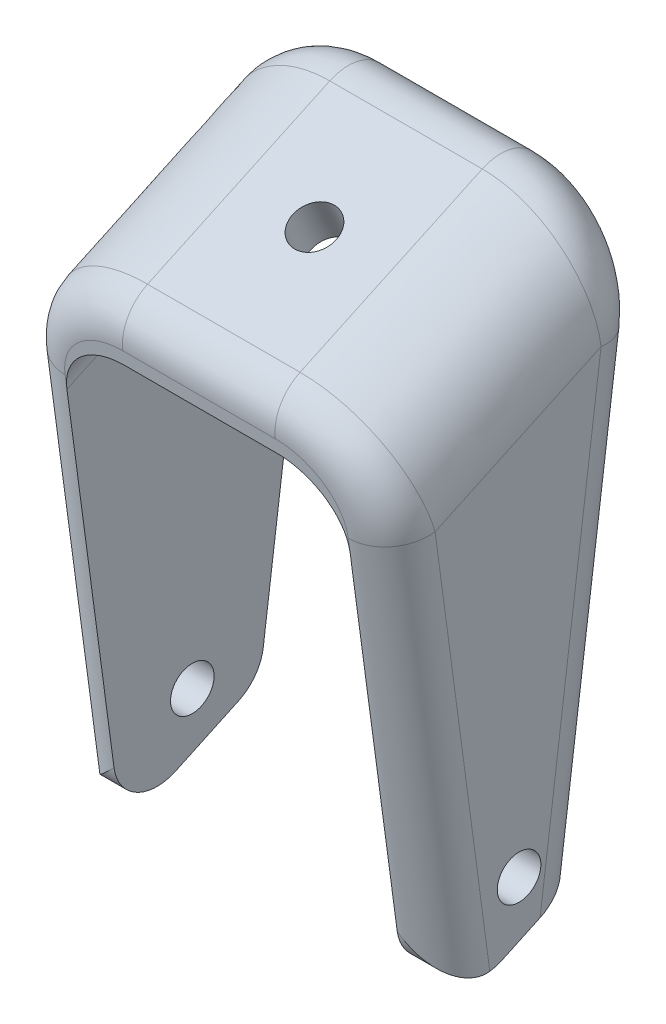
ISO-10303-21;
HEADER;
FILE_DESCRIPTION(('STEP AP214'),'2;1');
FILE_NAME('part.step','',(''),(''),'','','');
FILE_SCHEMA(('AUTOMOTIVE_DESIGN { 1 0 10303 214 1 1 1 1 }'));
ENDSEC;
DATA;
#1=APPLICATION_CONTEXT('core data for automotive mechanical design processes');
#2=APPLICATION_PROTOCOL_DEFINITION('international standard','automotive_design',2000,#1);
#3=PRODUCT_CONTEXT('',#1,'mechanical');
#4=PRODUCT('Part','Part','',(#3));
#5=PRODUCT_RELATED_PRODUCT_CATEGORY('part','',(#4));
#6=PRODUCT_DEFINITION_FORMATION('','',#4);
#7=PRODUCT_DEFINITION_CONTEXT('part definition',#1,'design');
#8=PRODUCT_DEFINITION('design','',#6,#7);
#9=PRODUCT_DEFINITION_SHAPE('','',#8);
#10=(LENGTH_UNIT() NAMED_UNIT(*) SI_UNIT(.MILLI.,.METRE.));
#11=(NAMED_UNIT(*) PLANE_ANGLE_UNIT() SI_UNIT($,.RADIAN.));
#12=(NAMED_UNIT(*) SI_UNIT($,.STERADIAN.) SOLID_ANGLE_UNIT());
#13=UNCERTAINTY_MEASURE_WITH_UNIT(LENGTH_MEASURE(1.E-05),#10,'distance_accuracy_value','');
#14=(GEOMETRIC_REPRESENTATION_CONTEXT(3) GLOBAL_UNCERTAINTY_ASSIGNED_CONTEXT((#13)) GLOBAL_UNIT_ASSIGNED_CONTEXT((#10,
#11,#12)) REPRESENTATION_CONTEXT('',''));
#15=CARTESIAN_POINT('',(0.,0.,0.));
#16=DIRECTION('',(0.,0.,1.));
#17=DIRECTION('',(1.,0.,0.));
#18=AXIS2_PLACEMENT_3D('',#15,#16,#17);
#19=CARTESIAN_POINT('',(-8.5,-14.46,0.));
#20=DIRECTION('',(0.,-0.906307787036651,-0.422618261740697));
#21=DIRECTION('',(0.,0.422618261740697,-0.906307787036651));
#22=AXIS2_PLACEMENT_3D('',#19,#20,#21);
#23=PLANE('',#22);
#24=DIRECTION('',(0.,-0.422618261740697,0.906307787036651));
#25=VECTOR('',#24,1.);
#26=CARTESIAN_POINT('',(-6.5,-10.8878760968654,-7.66044443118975));
#27=LINE('',#26,#25);
#28=CARTESIAN_POINT('',(-6.5,-16.5567621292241,4.49652089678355));
#29=VERTEX_POINT('',#28);
#30=CARTESIAN_POINT('',(-6.5,-17.9013663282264,7.38003390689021));
#31=VERTEX_POINT('',#30);
#32=EDGE_CURVE('E192',#29,#31,#27,.T.);
#33=ORIENTED_EDGE('',*,*,#32,.T.);
#34=DIRECTION('',(-1.,0.,0.));
#35=VECTOR('',#34,1.);
#36=CARTESIAN_POINT('',(-8.5,-17.9013663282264,7.38003390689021));
#37=LINE('',#36,#35);
#38=CARTESIAN_POINT('',(-8.5,-17.9013663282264,7.38003390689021));
#39=VERTEX_POINT('',#38);
#40=EDGE_CURVE('E613',#31,#39,#37,.T.);
#41=ORIENTED_EDGE('',*,*,#40,.T.);
#42=DIRECTION('',(0.,-0.422618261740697,0.906307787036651));
#43=VECTOR('',#42,1.);
#44=CARTESIAN_POINT('',(-8.5,-14.46,0.));
#45=LINE('',#44,#43);
#46=CARTESIAN_POINT('',(-8.5,-17.095044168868,5.65087045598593));
#47=VERTEX_POINT('',#46);
#48=EDGE_CURVE('E640',#47,#39,#45,.T.);
#49=ORIENTED_EDGE('',*,*,#48,.F.);
#50=CARTESIAN_POINT('',(-6.5,-17.095044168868,5.65087045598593));
#51=DIRECTION('',(0.,-0.906307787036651,-0.422618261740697));
#52=DIRECTION('',(0.,-0.422618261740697,0.906307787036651));
#53=AXIS2_PLACEMENT_3D('',#50,#51,#52);
#54=ELLIPSE('',#53,2.37113273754,2.);
#55=CARTESIAN_POINT('',(-8.18695743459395,-16.5567621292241,4.49652089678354));
#56=VERTEX_POINT('',#55);
#57=EDGE_CURVE('E619',#47,#56,#54,.T.);
#58=ORIENTED_EDGE('',*,*,#57,.T.);
#59=DIRECTION('',(-1.,0.,0.));
#60=VECTOR('',#59,1.);
#61=CARTESIAN_POINT('',(-6.5,-16.5567621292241,4.49652089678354));
#62=LINE('',#61,#60);
#63=EDGE_CURVE('E621',#56,#29,#62,.F.);
#64=ORIENTED_EDGE('',*,*,#63,.T.);
#65=EDGE_LOOP('',(#33,#41,#49,#58,#64));
#66=FACE_BOUND('',#65,.T.);
#67=ADVANCED_FACE('F35',(#66),#23,.T.);
#68=CARTESIAN_POINT('',(38.,-19.0512880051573,9.84604890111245));
#69=DIRECTION('',(0.,0.132855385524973,-0.991135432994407));
#70=DIRECTION('',(0.,0.991135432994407,0.132855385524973));
#71=AXIS2_PLACEMENT_3D('',#68,#69,#70);
#72=PLANE('',#71);
#73=CARTESIAN_POINT('',(-6.49999999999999,-1.69625820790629,12.172379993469));
#74=CARTESIAN_POINT('',(-8.49999999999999,-1.69625820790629,12.172379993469));
#75=CARTESIAN_POINT('',(-8.49999999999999,-1.43054743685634,10.1901091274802));
#76=CARTESIAN_POINT('',(-6.49999999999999,-1.00016098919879,12.2656873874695));
#77=CARTESIAN_POINT('',(-8.49999999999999,-1.00016098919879,12.2656873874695));
#78=CARTESIAN_POINT('',(-8.49999999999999,-0.734450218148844,10.2834165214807));
#79=CARTESIAN_POINT('',(-6.49999999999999,-0.304063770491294,12.35899478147));
#80=CARTESIAN_POINT('',(-8.49999999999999,-0.304063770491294,12.35899478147));
#81=CARTESIAN_POINT('',(-8.49999999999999,-0.0383529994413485,10.3767239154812));
#82=CARTESIAN_POINT('',(-6.49999999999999,0.392033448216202,12.4523021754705));
#83=CARTESIAN_POINT('',(-8.49999999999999,0.392033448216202,12.4523021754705));
#84=CARTESIAN_POINT('',(-8.49999999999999,0.657744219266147,10.4700313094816));
#85=CARTESIAN_POINT('',(-6.50001338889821,0.458499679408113,12.4612115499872));
#86=CARTESIAN_POINT('',(-8.48198756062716,0.51542243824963,12.4688416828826));
#87=CARTESIAN_POINT('',(-8.50004956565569,0.779283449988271,10.5046216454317));
#88=CARTESIAN_POINT('',(-6.4970839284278,0.524959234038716,12.4701200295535));
#89=CARTESIAN_POINT('',(-8.45867100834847,0.637800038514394,12.4852456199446));
#90=CARTESIAN_POINT('',(-8.49431618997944,0.900791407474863,10.5391996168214));
#91=CARTESIAN_POINT('',(-6.48544204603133,0.657356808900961,12.4878670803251));
#92=CARTESIAN_POINT('',(-8.40235947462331,0.878243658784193,12.5174755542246));
#93=CARTESIAN_POINT('',(-8.47165866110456,1.14239257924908,10.6078691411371));
#94=CARTESIAN_POINT('',(-6.47673160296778,0.723294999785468,12.4967056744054));
#95=CARTESIAN_POINT('',(-8.36944479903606,0.996378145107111,12.5333107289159));
#96=CARTESIAN_POINT('',(-8.45473833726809,1.26248626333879,10.6419608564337));
#97=CARTESIAN_POINT('',(-6.45367804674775,0.853917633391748,12.5142148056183));
#98=CARTESIAN_POINT('',(-8.29494155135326,1.22700550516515,12.5642248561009));
#99=CARTESIAN_POINT('',(-8.41017371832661,1.49950141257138,10.7090816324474));
#100=CARTESIAN_POINT('',(-6.43935833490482,0.918606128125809,12.5228858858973));
#101=CARTESIAN_POINT('',(-8.25344923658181,1.33959995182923,12.579317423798));
#102=CARTESIAN_POINT('',(-8.38257398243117,1.61643392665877,10.7421144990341));
#103=CARTESIAN_POINT('',(-6.40528641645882,1.04654673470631,12.5400355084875));
#104=CARTESIAN_POINT('',(-8.16268731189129,1.55901865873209,12.6087291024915));
#105=CARTESIAN_POINT('',(-8.31733373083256,1.84651598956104,10.8068934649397));
#106=CARTESIAN_POINT('',(-6.38553393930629,1.10979877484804,12.548514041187));
#107=CARTESIAN_POINT('',(-8.11345716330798,1.66593626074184,12.6230607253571));
#108=CARTESIAN_POINT('',(-8.27969271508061,1.9596653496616,10.8386395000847));
#109=CARTESIAN_POINT('',(-6.31850966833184,1.29664547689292,12.5735596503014));
#110=CARTESIAN_POINT('',(-7.95614603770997,1.97604337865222,12.6646286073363));
#111=CARTESIAN_POINT('',(-8.15295793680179,2.29178146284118,10.9314253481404));
#112=CARTESIAN_POINT('',(-6.26342682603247,1.41757538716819,12.5897695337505));
#113=CARTESIAN_POINT('',(-7.83730167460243,2.1718121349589,12.6908701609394));
#114=CARTESIAN_POINT('',(-8.0499645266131,2.50386181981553,10.9901393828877));
#115=CARTESIAN_POINT('',(-6.13483463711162,1.64937526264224,12.6208408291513));
#116=CARTESIAN_POINT('',(-7.57885277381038,2.53706770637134,12.7398303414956));
#117=CARTESIAN_POINT('',(-7.81409720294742,2.90445686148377,11.0999211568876));
#118=CARTESIAN_POINT('',(-6.06130857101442,1.76023597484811,12.6357010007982));
#119=CARTESIAN_POINT('',(-7.43919830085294,2.70724069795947,12.7626409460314));
#120=CARTESIAN_POINT('',(-7.68119618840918,3.09294992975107,11.1509818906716));
#121=CARTESIAN_POINT('',(-5.89292401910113,1.97705612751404,12.6647643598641));
#122=CARTESIAN_POINT('',(-7.13441506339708,3.03247224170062,12.806236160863));
#123=CARTESIAN_POINT('',(-7.38239063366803,3.4563416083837,11.2483926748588));
#124=CARTESIAN_POINT('',(-5.79695269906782,2.08216574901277,12.6788536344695));
#125=CARTESIAN_POINT('',(-6.96791956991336,3.18649032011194,12.8268813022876));
#126=CARTESIAN_POINT('',(-7.21485347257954,3.62943652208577,11.2941840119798));
#127=CARTESIAN_POINT('',(-5.59026067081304,2.27693058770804,12.7049606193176));
#128=CARTESIAN_POINT('',(-6.62197726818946,3.46644790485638,12.8644078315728));
#129=CARTESIAN_POINT('',(-6.86019026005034,3.94588994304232,11.3770353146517));
#130=CARTESIAN_POINT('',(-5.47953668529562,2.36658236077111,12.7169778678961));
#131=CARTESIAN_POINT('',(-6.44228451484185,3.59289195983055,12.8813568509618));
#132=CARTESIAN_POINT('',(-6.67305985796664,4.08924182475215,11.414093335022));
#133=CARTESIAN_POINT('',(-5.23288258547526,2.53877013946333,12.7400585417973));
#134=CARTESIAN_POINT('',(-6.05218526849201,3.83215172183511,12.9134280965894));
#135=CARTESIAN_POINT('',(-6.26200988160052,4.36159405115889,11.483881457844));
#136=CARTESIAN_POINT('',(-5.09551825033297,2.61928819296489,12.7508514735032));
#137=CARTESIAN_POINT('',(-5.84013087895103,3.9422748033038,12.9281893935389));
#138=CARTESIAN_POINT('',(-6.03633754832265,4.48702426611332,11.515617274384));
#139=CARTESIAN_POINT('',(-4.81002616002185,2.75885510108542,12.769559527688));
#140=CARTESIAN_POINT('',(-5.40778932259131,4.13101161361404,12.9534883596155));
#141=CARTESIAN_POINT('',(-5.57273101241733,4.70257418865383,11.5697567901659));
#142=CARTESIAN_POINT('',(-4.66188861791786,2.81788413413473,12.7774719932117));
#143=CARTESIAN_POINT('',(-5.18713792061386,4.20992446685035,12.9640661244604));
#144=CARTESIAN_POINT('',(-5.33478571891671,4.79266130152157,11.5921518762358));
#145=CARTESIAN_POINT('',(-4.34713269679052,2.9174469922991,12.7908177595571));
#146=CARTESIAN_POINT('',(-4.7240222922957,4.34207370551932,12.9817798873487));
#147=CARTESIAN_POINT('',(-4.83309862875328,4.94385287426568,11.6295725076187));
#148=CARTESIAN_POINT('',(-4.17996141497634,2.95626247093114,12.7960207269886));
#149=CARTESIAN_POINT('',(-4.48069710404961,4.39319492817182,12.9886323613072));
#150=CARTESIAN_POINT('',(-4.56876023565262,5.00227818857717,11.6439196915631));
#151=CARTESIAN_POINT('',(-3.84183275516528,3.00802204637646,12.802958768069));
#152=CARTESIAN_POINT('',(-3.99173966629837,4.46108417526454,12.9977324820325));
#153=CARTESIAN_POINT('',(-4.03621920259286,5.07992213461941,11.6629278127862));
#154=CARTESIAN_POINT('',(-3.67088127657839,3.02100392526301,12.8046989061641));
#155=CARTESIAN_POINT('',(-3.74570284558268,4.47801589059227,13.0000020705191));
#156=CARTESIAN_POINT('',(-3.76802278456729,5.09919802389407,11.6676028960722));
#157=CARTESIAN_POINT('',(-3.49999999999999,3.02095535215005,12.804692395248));
#158=CARTESIAN_POINT('',(-3.50000000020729,4.47800044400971,13.0000000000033));
#159=CARTESIAN_POINT('',(-3.50000000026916,5.09928169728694,11.6676580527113));
#160=CARTESIAN_POINT('',(-2.63118885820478,3.02095535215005,12.804692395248));
#161=CARTESIAN_POINT('',(-2.63118885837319,4.47800044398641,13.0000000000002));
#162=CARTESIAN_POINT('',(-2.63118885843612,5.09928169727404,11.6676580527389));
#163=CARTESIAN_POINT('',(-1.76237771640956,3.02095535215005,12.804692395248));
#164=CARTESIAN_POINT('',(-1.76237771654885,4.47800044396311,12.9999999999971));
#165=CARTESIAN_POINT('',(-1.76237771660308,5.09928169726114,11.6676580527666));
#166=CARTESIAN_POINT('',(-0.893566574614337,3.02095535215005,12.804692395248));
#167=CARTESIAN_POINT('',(-0.893566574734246,4.47800044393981,12.9999999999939));
#168=CARTESIAN_POINT('',(-0.893566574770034,5.09928169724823,11.6676580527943));
#169=(BOUNDED_SURFACE() B_SPLINE_SURFACE(3,2,((#73,#74,#75),(#76,#77,#78),(#79,#80,#81),(#82,
#83,#84),(#85,#86,#87),(#88,#89,#90),(#91,#92,#93),(#94,#95,#96),(#97,#98,#99),(#100,#101,#102),
(#103,#104,#105),(#106,#107,#108),(#109,#110,#111),(#112,#113,#114),(#115,#116,#117),(#118,#119,
#120),(#121,#122,#123),(#124,#125,#126),(#127,#128,#129),(#130,#131,#132),(#133,#134,#135),
(#136,#137,#138),(#139,#140,#141),(#142,#143,#144),(#145,#146,#147),(#148,#149,#150),(#151,#152,
#153),(#154,#155,#156),(#157,#158,#159),(#160,#161,#162),(#163,#164,#165),(#166,#167,#168)),
.UNSPECIFIED.,.F.,.F.,.F.) B_SPLINE_SURFACE_WITH_KNOTS((4,3,2,2,2,2,2,2,2,2,2,2,2,3,4),(3,3),
(0.,2.10696902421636,2.30807588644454,2.50911394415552,2.70932207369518,2.90954017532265,
3.3092333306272,3.70929014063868,4.13662907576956,4.56406310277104,5.04086735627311,
5.5181103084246,6.03113195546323,6.54340274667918,9.14983617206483),(0.,1.),
.UNSPECIFIED.) GEOMETRIC_REPRESENTATION_ITEM() RATIONAL_B_SPLINE_SURFACE(((1.,0.707106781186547,
1.),(1.,0.707106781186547,1.),(1.,0.707106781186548,1.),(1.,0.707106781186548,1.),(1.,
0.710313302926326,1.),(1.,0.713495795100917,1.),(1.,0.719768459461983,1.),(1.,0.722858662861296,
1.),(1.,0.728892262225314,1.),(1.,0.73183621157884,1.),(1.,0.737559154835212,1.),(1.,
0.740338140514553,1.),(1.,0.748386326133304,1.),(1.,0.753378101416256,1.),(1.,0.762545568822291,
1.),(1.,0.766720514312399,1.),(1.,0.774551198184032,1.),(1.,0.778152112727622,1.),(1.,
0.784563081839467,1.),(1.,0.787372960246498,1.),(1.,0.792593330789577,1.),(1.,0.794920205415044,
1.),(1.,0.798845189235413,1.),(1.,0.800442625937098,1.),(1.,0.803093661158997,1.),(1.,
0.804097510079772,1.),(1.,0.805420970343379,1.),(1.,0.805741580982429,1.),(1.,0.805749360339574,
1.),(1.,0.805749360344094,1.),(1.,0.805749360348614,1.),(1.,0.805749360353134,1.))) REPRESENTATION_ITEM('') SURFACE());
#170=CARTESIAN_POINT('',(-0.893566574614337,3.02095535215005,12.804692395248));
#171=CARTESIAN_POINT('',(-1.76237771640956,3.02095535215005,12.804692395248));
#172=CARTESIAN_POINT('',(-2.63118885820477,3.02095535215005,12.804692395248));
#173=CARTESIAN_POINT('',(-3.49999999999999,3.02095535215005,12.804692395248));
#174=CARTESIAN_POINT('',(-3.67088127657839,3.02100392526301,12.8046989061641));
#175=CARTESIAN_POINT('',(-3.84183275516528,3.00802204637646,12.802958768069));
#176=CARTESIAN_POINT('',(-4.17996141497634,2.95626247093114,12.7960207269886));
#177=CARTESIAN_POINT('',(-4.34713269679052,2.9174469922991,12.7908177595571));
#178=CARTESIAN_POINT('',(-4.66188861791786,2.81788413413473,12.7774719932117));
#179=CARTESIAN_POINT('',(-4.81002616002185,2.75885510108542,12.769559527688));
#180=CARTESIAN_POINT('',(-5.09551825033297,2.61928819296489,12.7508514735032));
#181=CARTESIAN_POINT('',(-5.23288258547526,2.53877013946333,12.7400585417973));
#182=CARTESIAN_POINT('',(-5.47953668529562,2.36658236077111,12.7169778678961));
#183=CARTESIAN_POINT('',(-5.59026067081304,2.27693058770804,12.7049606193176));
#184=CARTESIAN_POINT('',(-5.79695269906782,2.08216574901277,12.6788536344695));
#185=CARTESIAN_POINT('',(-5.89292401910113,1.97705612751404,12.6647643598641));
#186=CARTESIAN_POINT('',(-6.06130857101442,1.76023597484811,12.6357010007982));
#187=CARTESIAN_POINT('',(-6.13483463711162,1.64937526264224,12.6208408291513));
#188=CARTESIAN_POINT('',(-6.26342682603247,1.41757538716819,12.5897695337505));
#189=CARTESIAN_POINT('',(-6.31850966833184,1.29664547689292,12.5735596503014));
#190=CARTESIAN_POINT('',(-6.38553393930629,1.10979877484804,12.548514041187));
#191=CARTESIAN_POINT('',(-6.40528641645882,1.04654673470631,12.5400355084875));
#192=CARTESIAN_POINT('',(-6.43935833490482,0.918606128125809,12.5228858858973));
#193=CARTESIAN_POINT('',(-6.45367804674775,0.853917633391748,12.5142148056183));
#194=CARTESIAN_POINT('',(-6.47673160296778,0.723294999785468,12.4967056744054));
#195=CARTESIAN_POINT('',(-6.48544204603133,0.657356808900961,12.4878670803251));
#196=CARTESIAN_POINT('',(-6.4970839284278,0.524959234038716,12.4701200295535));
#197=CARTESIAN_POINT('',(-6.50001338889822,0.458499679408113,12.4612115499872));
#198=CARTESIAN_POINT('',(-6.49999999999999,0.392033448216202,12.4523021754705));
#199=CARTESIAN_POINT('',(-6.49999999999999,-0.304063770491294,12.35899478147));
#200=CARTESIAN_POINT('',(-6.49999999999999,-1.00016098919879,12.2656873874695));
#201=CARTESIAN_POINT('',(-6.49999999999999,-1.69625820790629,12.172379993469));
#202=B_SPLINE_CURVE_WITH_KNOTS('',3,(#170,#171,#172,#173,#174,#175,#176,#177,#178,#179,#180,
#181,#182,#183,#184,#185,#186,#187,#188,#189,#190,#191,#192,#193,#194,#195,#196,#197,#198,#199,
#200,#201),.UNSPECIFIED.,.F.,.F.,(4,3,2,2,2,2,2,2,2,2,2,2,2,3,4),(0.,2.60643342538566,
3.1187042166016,3.63172586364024,4.10896881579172,4.58577306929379,5.01320709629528,
5.44054603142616,5.84060284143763,6.24029599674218,6.44051409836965,6.64072222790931,
6.8417602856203,7.04286714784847,9.14983617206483),.UNSPECIFIED.);
#203=CARTESIAN_POINT('',(-3.49999999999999,3.02095535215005,12.804692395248));
#204=VERTEX_POINT('',#203);
#205=CARTESIAN_POINT('',(-6.49999999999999,0.392033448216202,12.4523021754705));
#206=VERTEX_POINT('',#205);
#207=EDGE_CURVE('E240',#204,#206,#202,.T.);
#208=ORIENTED_EDGE('',*,*,#207,.T.);
#209=DIRECTION('',(0.,-0.991135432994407,-0.132855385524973));
#210=VECTOR('',#209,1.);
#211=CARTESIAN_POINT('',(-6.5,-19.0512880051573,9.84604890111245));
#212=LINE('',#211,#210);
#213=CARTESIAN_POINT('',(-6.49999999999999,-0.227857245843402,12.3692097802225));
#214=VERTEX_POINT('',#213);
#215=EDGE_CURVE('E475',#206,#214,#212,.T.);
#216=ORIENTED_EDGE('',*,*,#215,.T.);
#217=CARTESIAN_POINT('',(-3.49999999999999,2.40106465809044,12.7216));
#218=CARTESIAN_POINT('',(-3.59259771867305,2.40105928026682,12.721599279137));
#219=CARTESIAN_POINT('',(-3.68515271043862,2.39726510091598,12.7210906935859));
#220=CARTESIAN_POINT('',(-3.86964294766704,2.38209493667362,12.719057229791));
#221=CARTESIAN_POINT('',(-3.96157808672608,2.37071768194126,12.717532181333));
#222=CARTESIAN_POINT('',(-4.23595269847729,2.32514921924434,12.7114240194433));
#223=CARTESIAN_POINT('',(-4.41660500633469,2.27952125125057,12.7053078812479));
#224=CARTESIAN_POINT('',(-4.76762645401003,2.1582133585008,12.689047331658));
#225=CARTESIAN_POINT('',(-4.93797890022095,2.0824860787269,12.6788965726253));
#226=CARTESIAN_POINT('',(-5.26217593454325,1.9020682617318,12.6547127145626));
#227=CARTESIAN_POINT('',(-5.41603811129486,1.79740901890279,12.6406838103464));
#228=CARTESIAN_POINT('',(-5.69225574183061,1.56809783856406,12.6099461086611));
#229=CARTESIAN_POINT('',(-5.81596661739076,1.44507052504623,12.5934550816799));
#230=CARTESIAN_POINT('',(-5.98195813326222,1.24481068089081,12.5666115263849));
#231=CARTESIAN_POINT('',(-6.03404594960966,1.1754014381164,12.5573076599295));
#232=CARTESIAN_POINT('',(-6.1310056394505,1.03177079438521,12.5380548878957));
#233=CARTESIAN_POINT('',(-6.1758789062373,0.957550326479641,12.5281061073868));
#234=CARTESIAN_POINT('',(-6.25283221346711,0.813937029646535,12.508855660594));
#235=CARTESIAN_POINT('',(-6.28579709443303,0.745008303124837,12.4996162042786));
#236=CARTESIAN_POINT('',(-6.34507025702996,0.604397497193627,12.480768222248));
#237=CARTESIAN_POINT('',(-6.37137978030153,0.532715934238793,12.4711597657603));
#238=CARTESIAN_POINT('',(-6.41688295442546,0.387350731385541,12.4516744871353));
#239=CARTESIAN_POINT('',(-6.4360931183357,0.313672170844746,12.4417983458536));
#240=CARTESIAN_POINT('',(-6.46715209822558,0.164843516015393,12.4218488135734));
#241=CARTESIAN_POINT('',(-6.47900611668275,0.0896945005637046,12.4117755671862));
#242=CARTESIAN_POINT('',(-6.49138576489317,-0.0260474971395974,12.3962610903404));
#243=CARTESIAN_POINT('',(-6.49461663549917,-0.0663727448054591,12.3908557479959));
#244=CARTESIAN_POINT('',(-6.49892274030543,-0.147082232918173,12.3800371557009));
#245=CARTESIAN_POINT('',(-6.50000083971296,-0.187466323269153,12.3746239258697));
#246=CARTESIAN_POINT('',(-6.49999999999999,-0.227857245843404,12.3692097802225));
#247=B_SPLINE_CURVE_WITH_KNOTS('',3,(#217,#218,#219,#220,#221,#222,#223,#224,#225,#226,#227,
#228,#229,#230,#231,#232,#233,#234,#235,#236,#237,#238,#239,#240,#241,#242,#243,#244,#245,#246),
.UNSPECIFIED.,.F.,.F.,(4,2,2,2,2,2,2,2,2,2,2,2,2,2,4),(0.,0.277627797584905,0.555302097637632,
1.11170657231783,1.66898992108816,2.22567282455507,2.74813284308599,3.00960757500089,
3.27103174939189,3.50160132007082,3.73212784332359,3.96211473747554,4.1919387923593,
4.3143304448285,4.43655909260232),.UNSPECIFIED.);
#248=CARTESIAN_POINT('',(-3.49999999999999,2.40106465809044,12.7216));
#249=VERTEX_POINT('',#248);
#250=EDGE_CURVE('E201',#249,#214,#247,.T.);
#251=ORIENTED_EDGE('',*,*,#250,.F.);
#252=DIRECTION('',(-1.,0.,0.));
#253=VECTOR('',#252,1.);
#254=CARTESIAN_POINT('',(-3.5,2.40106465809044,12.7216));
#255=LINE('',#254,#253);
#256=CARTESIAN_POINT('',(3.5,2.40106465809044,12.7216));
#257=VERTEX_POINT('',#256);
#258=EDGE_CURVE('E200',#257,#249,#255,.T.);
#259=ORIENTED_EDGE('',*,*,#258,.F.);
#260=CARTESIAN_POINT('',(6.5,-0.227857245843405,12.3692097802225));
#261=CARTESIAN_POINT('',(6.50001338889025,-0.161390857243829,12.3781191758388));
#262=CARTESIAN_POINT('',(6.49708391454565,-0.0949311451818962,12.3870276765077));
#263=CARTESIAN_POINT('',(6.48544197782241,0.0374667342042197,12.4047747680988));
#264=CARTESIAN_POINT('',(6.47673149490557,0.103405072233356,12.4136133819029));
#265=CARTESIAN_POINT('',(6.45367788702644,0.234027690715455,12.4311225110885));
#266=CARTESIAN_POINT('',(6.43935818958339,0.29871602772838,12.439793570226));
#267=CARTESIAN_POINT('',(6.40528632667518,0.426656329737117,12.4569431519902));
#268=CARTESIAN_POINT('',(6.38553389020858,0.489908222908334,12.4654216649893));
#269=CARTESIAN_POINT('',(6.31850972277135,0.676754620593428,12.4904672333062));
#270=CARTESIAN_POINT('',(6.26342694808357,0.79768438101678,12.5066770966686));
#271=CARTESIAN_POINT('',(6.1348348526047,1.02948427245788,12.5377483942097));
#272=CARTESIAN_POINT('',(6.06130876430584,1.14034512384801,12.5526085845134));
#273=CARTESIAN_POINT('',(5.89292390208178,1.35716548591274,12.5816719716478));
#274=CARTESIAN_POINT('',(5.7969522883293,1.46227519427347,12.5957612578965));
#275=CARTESIAN_POINT('',(5.59026096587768,1.6570398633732,12.6218682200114));
#276=CARTESIAN_POINT('',(5.47953798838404,1.74669138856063,12.6338854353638));
#277=CARTESIAN_POINT('',(5.23288112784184,1.91887975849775,12.6569661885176));
#278=CARTESIAN_POINT('',(5.09551245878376,1.99939877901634,12.667759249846));
#279=CARTESIAN_POINT('',(4.81003209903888,2.13896305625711,12.6864669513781));
#280=CARTESIAN_POINT('',(4.66191063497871,2.19798847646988,12.6943789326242));
#281=CARTESIAN_POINT('',(4.34710900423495,2.29756164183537,12.7077260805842));
#282=CARTESIAN_POINT('',(4.17987000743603,2.33639237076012,12.7129310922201));
#283=CARTESIAN_POINT('',(3.9262788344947,2.3752013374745,12.7181331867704));
#284=CARTESIAN_POINT('',(3.84132070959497,2.38489814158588,12.7194329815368));
#285=CARTESIAN_POINT('',(3.67092027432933,2.39782690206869,12.7211659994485));
#286=CARTESIAN_POINT('',(3.58547805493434,2.40106003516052,12.7215993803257));
#287=CARTESIAN_POINT('',(3.5,2.40106465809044,12.7216));
#288=B_SPLINE_CURVE_WITH_KNOTS('',3,(#260,#261,#262,#263,#264,#265,#266,#267,#268,#269,#270,
#271,#272,#273,#274,#275,#276,#277,#278,#279,#280,#281,#282,#283,#284,#285,#286,#287),
.UNSPECIFIED.,.F.,.F.,(4,2,2,2,2,2,2,2,2,2,2,2,2,4),(0.,0.201107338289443,0.40214585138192,
0.602353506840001,0.802571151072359,1.20226378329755,1.6023211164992,2.02966017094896,
2.45709407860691,2.93389821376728,3.41114128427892,3.92416313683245,4.18050952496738,
4.43680924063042),.UNSPECIFIED.);
#289=CARTESIAN_POINT('',(6.5,-0.227857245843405,12.3692097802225));
#290=VERTEX_POINT('',#289);
#291=EDGE_CURVE('E173',#290,#257,#288,.T.);
#292=ORIENTED_EDGE('',*,*,#291,.F.);
#293=DIRECTION('',(0.,0.991135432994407,0.132855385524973));
#294=VECTOR('',#293,1.);
#295=CARTESIAN_POINT('',(6.5,-0.227857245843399,12.3692097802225));
#296=LINE('',#295,#294);
#297=CARTESIAN_POINT('',(6.5,0.392033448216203,12.4523021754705));
#298=VERTEX_POINT('',#297);
#299=EDGE_CURVE('E196',#290,#298,#296,.T.);
#300=ORIENTED_EDGE('',*,*,#299,.T.);
#301=CARTESIAN_POINT('',(0.893566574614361,3.02095535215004,12.804692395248));
#302=CARTESIAN_POINT('',(0.89356657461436,4.47800044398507,13.));
#303=CARTESIAN_POINT('',(0.893566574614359,5.09928169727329,11.6676580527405));
#304=CARTESIAN_POINT('',(1.76237771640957,3.02095535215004,12.804692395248));
#305=CARTESIAN_POINT('',(1.76237771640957,4.47800044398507,13.));
#306=CARTESIAN_POINT('',(1.76237771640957,5.09928169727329,11.6676580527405));
#307=CARTESIAN_POINT('',(2.63118885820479,3.02095535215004,12.804692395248));
#308=CARTESIAN_POINT('',(2.63118885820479,4.47800044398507,13.));
#309=CARTESIAN_POINT('',(2.63118885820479,5.09928169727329,11.6676580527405));
#310=CARTESIAN_POINT('',(3.5,3.02095535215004,12.804692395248));
#311=CARTESIAN_POINT('',(3.5,4.47800044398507,13.));
#312=CARTESIAN_POINT('',(3.5,5.09928169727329,11.6676580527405));
#313=CARTESIAN_POINT('',(3.59259779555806,3.02094997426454,12.8046916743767));
#314=CARTESIAN_POINT('',(3.63315270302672,4.4779905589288,12.9999986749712));
#315=CARTESIAN_POINT('',(3.64525686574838,5.0992642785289,11.6676517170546));
#316=CARTESIAN_POINT('',(3.68515286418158,3.01715578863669,12.8041830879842));
#317=CARTESIAN_POINT('',(3.76627577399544,4.47303329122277,12.9993341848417));
#318=CARTESIAN_POINT('',(3.79044690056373,5.09359771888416,11.6662700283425));
#319=CARTESIAN_POINT('',(3.86964325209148,3.00198559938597,12.802149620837));
#320=CARTESIAN_POINT('',(4.03199941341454,4.45318146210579,12.9966731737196));
#321=CARTESIAN_POINT('',(4.08018856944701,5.07087765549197,11.6607159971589));
#322=CARTESIAN_POINT('',(3.96157846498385,2.99060832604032,12.8006245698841));
#323=CARTESIAN_POINT('',(4.16466388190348,4.43827567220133,12.994675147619));
#324=CARTESIAN_POINT('',(4.22474009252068,5.05382224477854,11.6565431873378));
#325=CARTESIAN_POINT('',(4.23595299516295,2.94503983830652,12.7945164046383));
#326=CARTESIAN_POINT('',(4.56200517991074,4.37841805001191,12.986651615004));
#327=CARTESIAN_POINT('',(4.65715336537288,4.985355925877,11.6397575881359));
#328=CARTESIAN_POINT('',(4.41660515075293,2.8994118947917,12.7884002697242));
#329=CARTESIAN_POINT('',(4.82552447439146,4.3182576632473,12.978587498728));
#330=CARTESIAN_POINT('',(4.94321782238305,4.91664424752,11.6228773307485));
#331=CARTESIAN_POINT('',(4.76762638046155,2.77810407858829,12.7721397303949));
#332=CARTESIAN_POINT('',(5.34425035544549,4.1567888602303,12.9569436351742));
#333=CARTESIAN_POINT('',(5.50429849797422,4.73198046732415,11.5770734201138));
#334=CARTESIAN_POINT('',(4.93797875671,2.70237683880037,12.761988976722));
#335=CARTESIAN_POINT('',(5.5999864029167,4.05506726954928,12.9433085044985));
#336=CARTESIAN_POINT('',(5.77929654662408,4.61595389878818,11.5481307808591));
#337=CARTESIAN_POINT('',(5.26217580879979,2.52195903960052,12.7378051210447));
#338=CARTESIAN_POINT('',(6.09754207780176,3.80900204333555,12.9103250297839));
#339=CARTESIAN_POINT('',(6.31009982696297,4.33519922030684,11.4771590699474));
#340=CARTESIAN_POINT('',(5.4160380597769,2.41729975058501,12.7237762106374));
#341=CARTESIAN_POINT('',(6.33994861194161,3.664096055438,12.8909013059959));
#342=CARTESIAN_POINT('',(6.56592540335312,4.1705236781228,11.4351441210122));
#343=CARTESIAN_POINT('',(5.69225576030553,2.18798852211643,12.6930385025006));
#344=CARTESIAN_POINT('',(6.79022531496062,3.3395674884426,12.847400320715));
#345=CARTESIAN_POINT('',(7.03378389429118,3.80235262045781,11.3396550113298));
#346=CARTESIAN_POINT('',(5.81596663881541,2.06496121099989,12.6765474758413));
#347=CARTESIAN_POINT('',(6.99990911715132,3.16170066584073,12.8235584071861));
#348=CARTESIAN_POINT('',(7.24754217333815,3.60186599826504,11.2870441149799));
#349=CARTESIAN_POINT('',(5.9819710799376,1.86468574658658,12.6497018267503));
#350=CARTESIAN_POINT('',(7.29420881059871,2.86490590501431,12.7837749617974));
#351=CARTESIAN_POINT('',(7.54004726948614,3.26837292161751,11.1980780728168));
#352=CARTESIAN_POINT('',(6.03407026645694,1.79525971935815,12.6403957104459));
#353=CARTESIAN_POINT('',(7.38950338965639,2.76023484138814,12.7697444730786));
#354=CARTESIAN_POINT('',(7.63290621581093,3.1516703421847,11.16672653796));
#355=CARTESIAN_POINT('',(6.13102656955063,1.65162688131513,12.6211426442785));
#356=CARTESIAN_POINT('',(7.57245824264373,2.54025227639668,12.7402572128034));
#357=CARTESIAN_POINT('',(7.80749013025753,2.90767779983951,11.1006749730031));
#358=CARTESIAN_POINT('',(6.17588843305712,1.57742324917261,12.6111961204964));
#359=CARTESIAN_POINT('',(7.66015258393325,2.42477221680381,12.7247778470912));
#360=CARTESIAN_POINT('',(7.8892223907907,2.780394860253,11.0659771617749));
#361=CARTESIAN_POINT('',(6.25283985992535,1.43381344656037,12.5919461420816));
#362=CARTESIAN_POINT('',(7.81656209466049,2.19748856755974,12.6943119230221));
#363=CARTESIAN_POINT('',(8.03079424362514,2.53153190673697,10.9976468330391));
#364=CARTESIAN_POINT('',(6.28581108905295,1.36486972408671,12.5827046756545));
#365=CARTESIAN_POINT('',(7.88636361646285,2.08661134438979,12.6794495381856));
#366=CARTESIAN_POINT('',(8.09207816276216,2.41104230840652,10.9643691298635));
#367=CARTESIAN_POINT('',(6.34508134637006,1.2242579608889,12.5638565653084));
#368=CARTESIAN_POINT('',(8.01764229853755,1.85678579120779,12.6486428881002));
#369=CARTESIAN_POINT('',(8.20310196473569,2.16327538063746,10.8955537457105));
#370=CARTESIAN_POINT('',(6.37138445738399,1.15259161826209,12.5542501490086));
#371=CARTESIAN_POINT('',(8.07910511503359,1.7376968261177,12.6326797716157));
#372=CARTESIAN_POINT('',(8.2528489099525,2.03600226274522,10.8600174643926));
#373=CARTESIAN_POINT('',(6.41688279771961,1.00724199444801,12.5347669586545));
#374=CARTESIAN_POINT('',(8.19230097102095,1.49211271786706,12.5997607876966));
#375=CARTESIAN_POINT('',(8.33943905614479,1.77608357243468,10.7871098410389));
#376=CARTESIAN_POINT('',(6.43609301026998,0.933563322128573,12.5248908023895));
#377=CARTESIAN_POINT('',(8.24400828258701,1.36548654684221,12.5827873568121));
#378=CARTESIAN_POINT('',(8.37630944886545,1.64344998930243,10.7497425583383));
#379=CARTESIAN_POINT('',(6.46715206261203,0.784734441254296,12.5049412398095));
#380=CARTESIAN_POINT('',(8.33644769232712,1.10544499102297,12.547930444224));
#381=CARTESIAN_POINT('',(8.43616753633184,1.37417779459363,10.6736293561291));
#382=CARTESIAN_POINT('',(6.47900610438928,0.70958531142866,12.4948679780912));
#383=CARTESIAN_POINT('',(8.37710966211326,0.971899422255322,12.5300295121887));
#384=CARTESIAN_POINT('',(8.45916504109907,1.2375420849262,10.6348844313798));
#385=CARTESIAN_POINT('',(6.49138576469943,0.593843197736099,12.4793534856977));
#386=CARTESIAN_POINT('',(8.42989902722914,0.763436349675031,12.5020863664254));
#387=CARTESIAN_POINT('',(8.48322229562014,1.02652542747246,10.5749426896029));
#388=CARTESIAN_POINT('',(6.49461663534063,0.55351795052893,12.4739481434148));
#389=CARTESIAN_POINT('',(8.44652123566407,0.690014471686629,12.4922446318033));
#390=CARTESIAN_POINT('',(8.48951167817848,0.952900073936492,10.5540092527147));
#391=CARTESIAN_POINT('',(6.49892274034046,0.472808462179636,12.463129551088));
#392=CARTESIAN_POINT('',(8.47608585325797,0.541873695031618,12.4723873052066));
#393=CARTESIAN_POINT('',(8.4978999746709,0.805435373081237,10.5120621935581));
#394=CARTESIAN_POINT('',(6.50000083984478,0.43242437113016,12.4577163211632));
#395=CARTESIAN_POINT('',(8.48901452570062,0.46714289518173,12.4623701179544));
#396=CARTESIAN_POINT('',(8.50000445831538,0.731596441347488,10.4910487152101));
#397=CARTESIAN_POINT('',(6.5,0.392033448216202,12.4523021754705));
#398=CARTESIAN_POINT('',(8.50000000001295,0.392033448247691,12.4523021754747));
#399=CARTESIAN_POINT('',(8.5,0.657744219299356,10.470031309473));
#400=CARTESIAN_POINT('',(6.5,-0.304063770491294,12.35899478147));
#401=CARTESIAN_POINT('',(8.50000000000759,-0.304063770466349,12.3589947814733));
#402=CARTESIAN_POINT('',(8.5,-0.0383529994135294,10.3767239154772));
#403=CARTESIAN_POINT('',(6.5,-1.00016098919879,12.2656873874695));
#404=CARTESIAN_POINT('',(8.50000000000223,-1.00016098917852,12.2656873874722));
#405=CARTESIAN_POINT('',(8.5,-0.734450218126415,10.2834165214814));
#406=CARTESIAN_POINT('',(6.5,-1.69625820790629,12.172379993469));
#407=CARTESIAN_POINT('',(8.49999999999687,-1.69625820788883,12.1723799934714));
#408=CARTESIAN_POINT('',(8.5,-1.4305474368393,10.1901091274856));
#409=(BOUNDED_SURFACE() B_SPLINE_SURFACE(3,2,((#301,#302,#303),(#304,#305,#306),(#307,#308,
#309),(#310,#311,#312),(#313,#314,#315),(#316,#317,#318),(#319,#320,#321),(#322,#323,#324),
(#325,#326,#327),(#328,#329,#330),(#331,#332,#333),(#334,#335,#336),(#337,#338,#339),(#340,#341,
#342),(#343,#344,#345),(#346,#347,#348),(#349,#350,#351),(#352,#353,#354),(#355,#356,#357),
(#358,#359,#360),(#361,#362,#363),(#364,#365,#366),(#367,#368,#369),(#370,#371,#372),(#373,#374,
#375),(#376,#377,#378),(#379,#380,#381),(#382,#383,#384),(#385,#386,#387),(#388,#389,#390),
(#391,#392,#393),(#394,#395,#396),(#397,#398,#399),(#400,#401,#402),(#403,#404,#405),(#406,#407,
#408)),.UNSPECIFIED.,.F.,.F.,.F.) B_SPLINE_SURFACE_WITH_KNOTS((4,3,2,2,2,2,2,2,2,2,2,2,2,2,2,3,
4),(3,3),(0.,2.60643342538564,2.88406145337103,3.16173597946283,3.71813999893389,
4.27542311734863,4.83210625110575,5.3545663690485,5.6161018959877,5.87746517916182,
6.10808365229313,6.33856057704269,6.56854781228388,6.7983722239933,6.92076387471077,
7.04299252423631,9.14996154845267),(0.,1.),
.UNSPECIFIED.) GEOMETRIC_REPRESENTATION_ITEM() RATIONAL_B_SPLINE_SURFACE(((1.,0.805749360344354,
1.),(1.,0.805749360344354,1.),(1.,0.805749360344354,1.),(1.,0.805749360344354,1.),(1.,
0.805748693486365,1.),(1.,0.805653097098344,1.),(1.,0.805267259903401,1.),(1.,0.804976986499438,
1.),(1.,0.803805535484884,1.),(1.,0.802623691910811,1.),(1.,0.799367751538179,1.),(1.,
0.797292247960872,1.),(1.,0.792094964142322,1.),(1.,0.788974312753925,1.),(1.,0.781694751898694,
1.),(1.,0.777611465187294,1.),(1.,0.770515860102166,1.),(1.,0.767987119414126,1.),(1.,
0.762588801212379,1.),(1.,0.759719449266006,1.),(1.,0.753993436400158,1.),(1.,0.751174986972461,
1.),(1.,0.745279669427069,1.),(1.,0.742202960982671,1.),(1.,0.735821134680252,1.),(1.,
0.732516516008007,1.),(1.,0.725716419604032,1.),(1.,0.722221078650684,1.),(1.,0.716763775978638,
1.),(1.,0.714848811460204,1.),(1.,0.710994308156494,1.),(1.,0.709054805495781,1.),(1.,
0.707106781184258,1.),(1.,0.707106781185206,1.),(1.,0.707106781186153,1.),(1.,0.707106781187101,1.))) REPRESENTATION_ITEM('') SURFACE());
#410=CARTESIAN_POINT('',(6.5,-1.69625820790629,12.172379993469));
#411=CARTESIAN_POINT('',(6.5,-1.00016098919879,12.2656873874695));
#412=CARTESIAN_POINT('',(6.5,-0.304063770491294,12.35899478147));
#413=CARTESIAN_POINT('',(6.5,0.392033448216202,12.4523021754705));
#414=CARTESIAN_POINT('',(6.50000083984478,0.43242437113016,12.4577163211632));
#415=CARTESIAN_POINT('',(6.49892274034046,0.472808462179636,12.463129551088));
#416=CARTESIAN_POINT('',(6.49461663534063,0.55351795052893,12.4739481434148));
#417=CARTESIAN_POINT('',(6.49138576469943,0.593843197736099,12.4793534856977));
#418=CARTESIAN_POINT('',(6.47900610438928,0.70958531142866,12.4948679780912));
#419=CARTESIAN_POINT('',(6.46715206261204,0.784734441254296,12.5049412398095));
#420=CARTESIAN_POINT('',(6.43609301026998,0.933563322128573,12.5248908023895));
#421=CARTESIAN_POINT('',(6.41688279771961,1.00724199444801,12.5347669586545));
#422=CARTESIAN_POINT('',(6.37138445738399,1.15259161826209,12.5542501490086));
#423=CARTESIAN_POINT('',(6.34508134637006,1.2242579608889,12.5638565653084));
#424=CARTESIAN_POINT('',(6.28581108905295,1.36486972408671,12.5827046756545));
#425=CARTESIAN_POINT('',(6.25283985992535,1.43381344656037,12.5919461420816));
#426=CARTESIAN_POINT('',(6.17588843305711,1.57742324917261,12.6111961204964));
#427=CARTESIAN_POINT('',(6.13102656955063,1.65162688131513,12.6211426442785));
#428=CARTESIAN_POINT('',(6.03407026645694,1.79525971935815,12.6403957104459));
#429=CARTESIAN_POINT('',(5.9819710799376,1.86468574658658,12.6497018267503));
#430=CARTESIAN_POINT('',(5.81596663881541,2.06496121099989,12.6765474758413));
#431=CARTESIAN_POINT('',(5.69225576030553,2.18798852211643,12.6930385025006));
#432=CARTESIAN_POINT('',(5.4160380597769,2.41729975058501,12.7237762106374));
#433=CARTESIAN_POINT('',(5.26217580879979,2.52195903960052,12.7378051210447));
#434=CARTESIAN_POINT('',(4.93797875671,2.70237683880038,12.761988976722));
#435=CARTESIAN_POINT('',(4.76762638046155,2.77810407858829,12.7721397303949));
#436=CARTESIAN_POINT('',(4.41660515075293,2.8994118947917,12.7884002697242));
#437=CARTESIAN_POINT('',(4.23595299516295,2.94503983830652,12.7945164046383));
#438=CARTESIAN_POINT('',(3.96157846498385,2.99060832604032,12.8006245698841));
#439=CARTESIAN_POINT('',(3.86964325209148,3.00198559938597,12.802149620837));
#440=CARTESIAN_POINT('',(3.68515286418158,3.01715578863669,12.8041830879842));
#441=CARTESIAN_POINT('',(3.59259779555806,3.02094997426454,12.8046916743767));
#442=CARTESIAN_POINT('',(3.5,3.02095535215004,12.804692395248));
#443=CARTESIAN_POINT('',(2.63118885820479,3.02095535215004,12.804692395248));
#444=CARTESIAN_POINT('',(1.76237771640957,3.02095535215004,12.804692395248));
#445=CARTESIAN_POINT('',(0.893566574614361,3.02095535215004,12.804692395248));
#446=B_SPLINE_CURVE_WITH_KNOTS('',3,(#410,#411,#412,#413,#414,#415,#416,#417,#418,#419,#420,
#421,#422,#423,#424,#425,#426,#427,#428,#429,#430,#431,#432,#433,#434,#435,#436,#437,#438,#439,
#440,#441,#442,#443,#444,#445),.UNSPECIFIED.,.F.,.F.,(4,3,2,2,2,2,2,2,2,2,2,2,2,2,2,3,4),(0.,
2.10696902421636,2.2291976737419,2.35158932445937,2.58141373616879,2.81140097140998,
3.04187789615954,3.27249636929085,3.53385965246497,3.79539517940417,4.31785529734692,
4.87453843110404,5.43182154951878,5.98822556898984,6.26590009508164,6.54352812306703,
9.14996154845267),.UNSPECIFIED.);
#447=CARTESIAN_POINT('',(3.5,3.02095535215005,12.804692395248));
#448=VERTEX_POINT('',#447);
#449=EDGE_CURVE('E207',#298,#448,#446,.T.);
#450=ORIENTED_EDGE('',*,*,#449,.T.);
#451=DIRECTION('',(-1.,0.,0.));
#452=VECTOR('',#451,1.);
#453=CARTESIAN_POINT('',(-3.5,3.02095535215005,12.804692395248));
#454=LINE('',#453,#452);
#455=EDGE_CURVE('E210',#448,#204,#454,.T.);
#456=ORIENTED_EDGE('',*,*,#455,.T.);
#457=EDGE_LOOP('',(#208,#216,#251,#259,#292,#300,#450,#456));
#458=FACE_BOUND('',#457,.T.);
#459=ADVANCED_FACE('F195',(#458),#72,.F.);
#460=DIRECTION('',(0.,-0.422618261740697,0.906307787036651));
#461=VECTOR('',#460,1.);
#462=CARTESIAN_POINT('',(8.5,-14.46,0.));
#463=LINE('',#462,#461);
#464=CARTESIAN_POINT('',(8.5,-17.095044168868,5.65087045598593));
#465=VERTEX_POINT('',#464);
#466=CARTESIAN_POINT('',(8.5,-17.9013663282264,7.38003390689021));
#467=VERTEX_POINT('',#466);
#468=EDGE_CURVE('E631',#465,#467,#463,.T.);
#469=ORIENTED_EDGE('',*,*,#468,.T.);
#470=DIRECTION('',(-1.,0.,0.));
#471=VECTOR('',#470,1.);
#472=CARTESIAN_POINT('',(6.50000000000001,-17.9013663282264,7.38003390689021));
#473=LINE('',#472,#471);
#474=CARTESIAN_POINT('',(6.5,-17.9013663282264,7.38003390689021));
#475=VERTEX_POINT('',#474);
#476=EDGE_CURVE('E565',#467,#475,#473,.T.);
#477=ORIENTED_EDGE('',*,*,#476,.T.);
#478=DIRECTION('',(0.,-0.422618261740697,0.906307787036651));
#479=VECTOR('',#478,1.);
#480=CARTESIAN_POINT('',(6.5,-14.46,0.));
#481=LINE('',#480,#479);
#482=CARTESIAN_POINT('',(6.5,-16.5567621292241,4.49652089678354));
#483=VERTEX_POINT('',#482);
#484=EDGE_CURVE('E180',#483,#475,#481,.T.);
#485=ORIENTED_EDGE('',*,*,#484,.F.);
#486=DIRECTION('',(-1.,0.,0.));
#487=VECTOR('',#486,1.);
#488=CARTESIAN_POINT('',(8.5,-16.5567621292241,4.49652089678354));
#489=LINE('',#488,#487);
#490=CARTESIAN_POINT('',(8.18695743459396,-16.5567621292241,4.49652089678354));
#491=VERTEX_POINT('',#490);
#492=EDGE_CURVE('E58',#483,#491,#489,.F.);
#493=ORIENTED_EDGE('',*,*,#492,.T.);
#494=CARTESIAN_POINT('',(6.50000000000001,-17.095044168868,5.65087045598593));
#495=DIRECTION('',(0.,-0.906307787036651,-0.422618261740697));
#496=DIRECTION('',(0.,0.422618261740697,-0.906307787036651));
#497=AXIS2_PLACEMENT_3D('',#494,#495,#496);
#498=ELLIPSE('',#497,2.37113273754,2.);
#499=EDGE_CURVE('E568',#491,#465,#498,.T.);
#500=ORIENTED_EDGE('',*,*,#499,.T.);
#501=EDGE_LOOP('',(#469,#477,#485,#493,#500));
#502=FACE_BOUND('',#501,.T.);
#503=ADVANCED_FACE('F233',(#502),#23,.T.);
#504=CARTESIAN_POINT('',(8.5,5.54000000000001,0.));
#505=DIRECTION('',(1.,0.,0.));
#506=DIRECTION('',(0.,1.,0.));
#507=AXIS2_PLACEMENT_3D('',#504,#505,#506);
#508=PLANE('',#507);
#509=CARTESIAN_POINT('',(8.50000000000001,-14.9982052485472,6.61424362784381));
#510=DIRECTION('',(1.,0.,0.));
#511=DIRECTION('',(0.,1.,0.));
#512=AXIS2_PLACEMENT_3D('',#509,#510,#511);
#513=CIRCLE('',#512,1.);
#514=CARTESIAN_POINT('',(8.50000000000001,-13.9982052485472,6.61424362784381));
#515=VERTEX_POINT('',#514);
#516=EDGE_CURVE('E439',#515,#515,#513,.F.);
#517=ORIENTED_EDGE('',*,*,#516,.T.);
#518=EDGE_LOOP('',(#517));
#519=FACE_BOUND('',#518,.T.);
#520=DIRECTION('',(0.,0.991135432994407,0.132855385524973));
#521=VECTOR('',#520,1.);
#522=CARTESIAN_POINT('',(8.5,-18.7855772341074,7.86377803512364));
#523=LINE('',#522,#521);
#524=CARTESIAN_POINT('',(8.5,0.657744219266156,10.4700313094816));
#525=VERTEX_POINT('',#524);
#526=CARTESIAN_POINT('',(8.5,-18.0710216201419,7.95955965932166));
#527=VERTEX_POINT('',#526);
#528=EDGE_CURVE('E44',#525,#527,#523,.F.);
#529=ORIENTED_EDGE('',*,*,#528,.T.);
#530=CARTESIAN_POINT('',(8.5,-16.0887507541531,8.2252704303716));
#531=DIRECTION('',(1.,0.,0.));
#532=DIRECTION('',(0.,1.,0.));
#533=AXIS2_PLACEMENT_3D('',#530,#531,#532);
#534=CIRCLE('',#533,2.);
#535=EDGE_CURVE('E12',#527,#467,#534,.T.);
#536=ORIENTED_EDGE('',*,*,#535,.T.);
#537=ORIENTED_EDGE('',*,*,#468,.F.);
#538=DIRECTION('',(0.,-0.99146605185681,0.130365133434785));
#539=VECTOR('',#538,1.);
#540=CARTESIAN_POINT('',(8.5,5.47413823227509,2.6833109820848));
#541=LINE('',#540,#539);
#542=CARTESIAN_POINT('',(8.5,4.21132396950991,2.84935494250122));
#543=VERTEX_POINT('',#542);
#544=EDGE_CURVE('E563',#465,#543,#541,.F.);
#545=ORIENTED_EDGE('',*,*,#544,.T.);
#546=DIRECTION('',(0.,-0.422618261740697,0.906307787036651));
#547=VECTOR('',#546,1.);
#548=CARTESIAN_POINT('',(8.5,5.54000000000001,0.));
#549=LINE('',#548,#547);
#550=EDGE_CURVE('E627',#543,#525,#549,.T.);
#551=ORIENTED_EDGE('',*,*,#550,.T.);
#552=EDGE_LOOP('',(#529,#536,#537,#545,#551));
#553=FACE_BOUND('',#552,.T.);
#554=ADVANCED_FACE('F364',(#519,#553),#508,.T.);
#555=CARTESIAN_POINT('',(8.5,5.54000000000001,0.));
#556=CARTESIAN_POINT('',(8.5,-0.521999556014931,13.));
#557=CARTESIAN_POINT('',(8.5,-0.78631976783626,13.5668365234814));
#558=CARTESIAN_POINT('',(8.5,8.46893218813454,0.));
#559=CARTESIAN_POINT('',(8.5,2.40693263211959,13.));
#560=CARTESIAN_POINT('',(8.5,2.14261242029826,13.5668365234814));
#561=CARTESIAN_POINT('',(6.42893218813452,10.54,0.));
#562=CARTESIAN_POINT('',(6.42893218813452,4.47800044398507,13.));
#563=CARTESIAN_POINT('',(6.42893218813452,4.21368023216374,13.5668365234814));
#564=CARTESIAN_POINT('',(3.5,10.54,0.));
#565=CARTESIAN_POINT('',(3.5,4.47800044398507,13.));
#566=CARTESIAN_POINT('',(3.5,4.21368023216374,13.5668365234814));
#567=(BOUNDED_SURFACE() B_SPLINE_SURFACE(3,1,((#555,#556,#557),(#558,#559,#560),(#561,#562,
#563),(#564,#565,#566)),.UNSPECIFIED.,.F.,.F.,.F.) B_SPLINE_SURFACE_WITH_KNOTS((4,4),(2,1,2),
(0.,1.),(0.,1.,1.04360280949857),
.UNSPECIFIED.) GEOMETRIC_REPRESENTATION_ITEM() RATIONAL_B_SPLINE_SURFACE(((1.,1.,1.),
(0.804737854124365,0.804737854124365,0.804737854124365),(0.804737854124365,0.804737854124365,
0.804737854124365),(1.,1.,1.))) REPRESENTATION_ITEM('') SURFACE());
#568=DIRECTION('',(0.,-0.422618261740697,0.906307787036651));
#569=VECTOR('',#568,1.);
#570=CARTESIAN_POINT('',(3.5,10.54,0.));
#571=LINE('',#570,#569);
#572=CARTESIAN_POINT('',(3.5,8.99963396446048,3.30332562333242));
#573=VERTEX_POINT('',#572);
#574=CARTESIAN_POINT('',(3.5,5.09928169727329,11.6676580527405));
#575=VERTEX_POINT('',#574);
#576=EDGE_CURVE('E531',#573,#575,#571,.T.);
#577=CARTESIAN_POINT('',(0.893566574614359,5.09928169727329,11.6676580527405));
#578=CARTESIAN_POINT('',(1.76237771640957,5.09928169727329,11.6676580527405));
#579=CARTESIAN_POINT('',(2.63118885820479,5.09928169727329,11.6676580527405));
#580=CARTESIAN_POINT('',(3.5,5.09928169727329,11.6676580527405));
#581=CARTESIAN_POINT('',(3.64525686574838,5.0992642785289,11.6676517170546));
#582=CARTESIAN_POINT('',(3.79044690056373,5.09359771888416,11.6662700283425));
#583=CARTESIAN_POINT('',(4.08018856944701,5.07087765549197,11.6607159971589));
#584=CARTESIAN_POINT('',(4.22474009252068,5.05382224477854,11.6565431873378));
#585=CARTESIAN_POINT('',(4.65715336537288,4.985355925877,11.6397575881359));
#586=CARTESIAN_POINT('',(4.94321782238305,4.91664424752,11.6228773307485));
#587=CARTESIAN_POINT('',(5.50429849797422,4.73198046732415,11.5770734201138));
#588=CARTESIAN_POINT('',(5.77929654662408,4.61595389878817,11.5481307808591));
#589=CARTESIAN_POINT('',(6.31009982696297,4.33519922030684,11.4771590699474));
#590=CARTESIAN_POINT('',(6.56592540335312,4.1705236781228,11.4351441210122));
#591=CARTESIAN_POINT('',(7.03378389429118,3.80235262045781,11.3396550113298));
#592=CARTESIAN_POINT('',(7.24754217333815,3.60186599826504,11.2870441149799));
#593=CARTESIAN_POINT('',(7.54004726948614,3.26837292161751,11.1980780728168));
#594=CARTESIAN_POINT('',(7.63290621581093,3.1516703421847,11.16672653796));
#595=CARTESIAN_POINT('',(7.80749013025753,2.90767779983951,11.1006749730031));
#596=CARTESIAN_POINT('',(7.8892223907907,2.780394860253,11.0659771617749));
#597=CARTESIAN_POINT('',(8.03079424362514,2.53153190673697,10.9976468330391));
#598=CARTESIAN_POINT('',(8.09207816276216,2.41104230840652,10.9643691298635));
#599=CARTESIAN_POINT('',(8.20310196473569,2.16327538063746,10.8955537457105));
#600=CARTESIAN_POINT('',(8.2528489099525,2.03600226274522,10.8600174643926));
#601=CARTESIAN_POINT('',(8.33943905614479,1.77608357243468,10.7871098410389));
#602=CARTESIAN_POINT('',(8.37630944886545,1.64344998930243,10.7497425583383));
#603=CARTESIAN_POINT('',(8.43616753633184,1.37417779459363,10.6736293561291));
#604=CARTESIAN_POINT('',(8.45916504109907,1.2375420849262,10.6348844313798));
#605=CARTESIAN_POINT('',(8.48322229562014,1.02652542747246,10.5749426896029));
#606=CARTESIAN_POINT('',(8.48951167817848,0.952900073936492,10.5540092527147));
#607=CARTESIAN_POINT('',(8.4978999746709,0.805435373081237,10.5120621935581));
#608=CARTESIAN_POINT('',(8.50000445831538,0.731596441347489,10.4910487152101));
#609=CARTESIAN_POINT('',(8.5,0.657744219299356,10.470031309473));
#610=CARTESIAN_POINT('',(8.5,-0.0383529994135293,10.3767239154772));
#611=CARTESIAN_POINT('',(8.5,-0.734450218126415,10.2834165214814));
#612=CARTESIAN_POINT('',(8.5,-1.4305474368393,10.1901091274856));
#613=B_SPLINE_CURVE_WITH_KNOTS('',3,(#577,#578,#579,#580,#581,#582,#583,#584,#585,#586,#587,
#588,#589,#590,#591,#592,#593,#594,#595,#596,#597,#598,#599,#600,#601,#602,#603,#604,#605,#606,
#607,#608,#609,#610,#611,#612),.UNSPECIFIED.,.F.,.F.,(4,3,2,2,2,2,2,2,2,2,2,2,2,2,2,3,4),(0.,
2.60643342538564,2.88406145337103,3.16173597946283,3.71813999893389,4.27542311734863,
4.83210625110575,5.3545663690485,5.6161018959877,5.87746517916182,6.10808365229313,
6.33856057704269,6.56854781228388,6.7983722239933,6.92076387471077,7.04299252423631,
9.14996154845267),.UNSPECIFIED.);
#614=EDGE_CURVE('E591',#575,#525,#613,.T.);
#615=CARTESIAN_POINT('',(6.5,1.86160544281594,1.14109813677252));
#616=CARTESIAN_POINT('',(7.32842712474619,1.86160544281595,1.14109813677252));
#617=CARTESIAN_POINT('',(7.91421356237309,1.93797156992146,1.72188550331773));
#618=CARTESIAN_POINT('',(8.5,2.01433769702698,2.30267286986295));
#619=CARTESIAN_POINT('',(8.5,2.12233570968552,3.12403024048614));
#620=CARTESIAN_POINT('',(6.5,2.55793486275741,1.04953970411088));
#621=CARTESIAN_POINT('',(7.32842712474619,2.55793486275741,1.04953970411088));
#622=CARTESIAN_POINT('',(7.91421356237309,2.63430098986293,1.63032707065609));
#623=CARTESIAN_POINT('',(8.5,2.71066711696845,2.21111443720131));
#624=CARTESIAN_POINT('',(8.5,2.81866512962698,3.0324718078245));
#625=CARTESIAN_POINT('',(6.5,3.25426428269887,0.957981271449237));
#626=CARTESIAN_POINT('',(7.32842712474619,3.25426428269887,0.957981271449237));
#627=CARTESIAN_POINT('',(7.91421356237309,3.33063040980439,1.53876863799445));
#628=CARTESIAN_POINT('',(8.5,3.40699653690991,2.11955600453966));
#629=CARTESIAN_POINT('',(8.5,3.51499454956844,2.94091337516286));
#630=CARTESIAN_POINT('',(6.5,3.95059370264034,0.866422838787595));
#631=CARTESIAN_POINT('',(7.32842712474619,3.95059370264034,0.866422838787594));
#632=CARTESIAN_POINT('',(7.91421356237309,4.02695982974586,1.44721020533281));
#633=CARTESIAN_POINT('',(8.5,4.10332595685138,2.02799757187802));
#634=CARTESIAN_POINT('',(8.5,4.21132396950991,2.84935494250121));
#635=CARTESIAN_POINT('',(6.50001371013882,4.0396772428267,0.854709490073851));
#636=CARTESIAN_POINT('',(7.33979424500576,4.0648224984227,0.851403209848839));
#637=CARTESIAN_POINT('',(7.92791571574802,4.16034833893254,1.44345045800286));
#638=CARTESIAN_POINT('',(8.51609838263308,4.25644277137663,2.03548268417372));
#639=CARTESIAN_POINT('',(8.50007203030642,4.36562832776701,2.86805456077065));
#640=CARTESIAN_POINT('',(6.49591120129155,4.12875463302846,0.8429969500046));
#641=CARTESIAN_POINT('',(7.34590171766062,4.17985541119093,0.836277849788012));
#642=CARTESIAN_POINT('',(7.93529969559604,4.2950206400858,1.43972298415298));
#643=CARTESIAN_POINT('',(8.52470304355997,4.41075236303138,2.04315276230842));
#644=CARTESIAN_POINT('',(8.49203031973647,4.51988277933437,2.88673458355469));
#645=CARTESIAN_POINT('',(6.47957854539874,4.30616623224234,0.819669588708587));
#646=CARTESIAN_POINT('',(7.34743676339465,4.41093148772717,0.805894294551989));
#647=CARTESIAN_POINT('',(7.93713054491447,4.56548522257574,1.43226215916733));
#648=CARTESIAN_POINT('',(8.52682651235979,4.72058959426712,2.05861456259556));
#649=CARTESIAN_POINT('',(8.46026376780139,4.82634504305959,2.92358453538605));
#650=CARTESIAN_POINT('',(6.46734914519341,4.39450050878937,0.808054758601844));
#651=CARTESIAN_POINT('',(7.34282108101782,4.52698665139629,0.790634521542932));
#652=CARTESIAN_POINT('',(7.931578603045,4.70127739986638,1.42852880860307));
#653=CARTESIAN_POINT('',(8.52028421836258,4.87613277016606,2.06640730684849));
#654=CARTESIAN_POINT('',(8.43654036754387,4.97855304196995,2.94175451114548));
#655=CARTESIAN_POINT('',(6.43490177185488,4.56952660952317,0.785041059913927));
#656=CARTESIAN_POINT('',(7.32263073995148,4.75880065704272,0.760153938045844));
#657=CARTESIAN_POINT('',(7.90726517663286,4.9722726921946,1.42099310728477));
#658=CARTESIAN_POINT('',(8.49184985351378,5.18631330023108,2.08181655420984));
#659=CARTESIAN_POINT('',(8.37402069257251,5.2786873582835,2.97707973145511));
#660=CARTESIAN_POINT('',(6.41470072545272,4.65622150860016,0.773641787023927));
#661=CARTESIAN_POINT('',(7.30703332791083,4.87455946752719,0.74493313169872));
#662=CARTESIAN_POINT('',(7.88853161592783,5.1074764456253,1.41719091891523));
#663=CARTESIAN_POINT('',(8.46992591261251,5.34094955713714,2.08943273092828));
#664=CARTESIAN_POINT('',(8.33525635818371,5.42662203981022,2.99423703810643));
#665=CARTESIAN_POINT('',(6.36652902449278,4.82743159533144,0.751129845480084));
#666=CARTESIAN_POINT('',(7.26482254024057,5.10487891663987,0.714649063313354));
#667=CARTESIAN_POINT('',(7.83791701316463,5.37608151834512,1.40946729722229));
#668=CARTESIAN_POINT('',(8.41090498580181,5.6478450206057,2.10426938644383));
#669=CARTESIAN_POINT('',(8.24364304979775,5.71687521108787,3.02723579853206));
#670=CARTESIAN_POINT('',(6.33855885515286,4.91194691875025,0.740017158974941));
#671=CARTESIAN_POINT('',(7.2381655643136,5.21942530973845,0.699587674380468));
#672=CARTESIAN_POINT('',(7.80603679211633,5.5094829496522,1.40554587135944));
#673=CARTESIAN_POINT('',(8.37374798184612,5.80008203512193,2.11148763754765));
#674=CARTESIAN_POINT('',(8.19079495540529,5.85919405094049,3.04307733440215));
#675=CARTESIAN_POINT('',(6.24762330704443,5.15003940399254,0.708711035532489));
#676=CARTESIAN_POINT('',(7.14584456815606,5.54490490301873,0.656791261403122));
#677=CARTESIAN_POINT('',(7.69607304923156,5.88715008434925,1.39410645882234));
#678=CARTESIAN_POINT('',(8.24576370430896,6.2312577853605,2.13136529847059));
#679=CARTESIAN_POINT('',(8.02075033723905,6.25698707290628,3.08624079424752));
#680=CARTESIAN_POINT('',(6.17529798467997,5.30021701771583,0.68896459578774));
#681=CARTESIAN_POINT('',(7.06647752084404,5.75244442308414,0.629502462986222));
#682=CARTESIAN_POINT('',(7.60186586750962,6.12765210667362,1.38640748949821));
#683=CARTESIAN_POINT('',(8.13644912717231,6.50446175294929,2.14325762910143));
#684=CARTESIAN_POINT('',(7.88740017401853,6.50402389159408,3.11166054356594));
#685=CARTESIAN_POINT('',(6.0066646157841,5.58657691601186,0.651311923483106));
#686=CARTESIAN_POINT('',(6.87108611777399,6.15252808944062,0.576896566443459));
#687=CARTESIAN_POINT('',(7.37114106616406,6.58920458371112,1.37068797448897));
#688=CARTESIAN_POINT('',(7.87038282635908,7.02751644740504,2.16442401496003));
#689=CARTESIAN_POINT('',(7.58338356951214,6.96767975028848,3.15668233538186));
#690=CARTESIAN_POINT('',(5.91035700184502,5.72275945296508,0.633405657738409));
#691=CARTESIAN_POINT('',(6.75488454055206,6.3448008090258,0.551615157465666));
#692=CARTESIAN_POINT('',(7.2346242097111,6.81025538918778,1.36266743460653));
#693=CARTESIAN_POINT('',(7.71340724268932,7.27698591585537,2.17367085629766));
#694=CARTESIAN_POINT('',(7.41271780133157,7.18429933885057,3.17628448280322));
#695=CARTESIAN_POINT('',(5.69480338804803,5.97952224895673,0.599644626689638));
#696=CARTESIAN_POINT('',(6.48660623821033,6.71077084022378,0.503494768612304));
#697=CARTESIAN_POINT('',(6.92110302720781,7.22909876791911,1.34663583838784));
#698=CARTESIAN_POINT('',(7.3546088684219,7.74875263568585,2.18972617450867));
#699=CARTESIAN_POINT('',(7.03845745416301,7.58682924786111,3.2104957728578));
#700=CARTESIAN_POINT('',(5.57522986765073,6.09983279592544,0.583825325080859));
#701=CARTESIAN_POINT('',(6.33394439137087,6.88379395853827,0.480744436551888));
#702=CARTESIAN_POINT('',(6.74351282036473,7.42648508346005,1.33862679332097));
#703=CARTESIAN_POINT('',(7.15207184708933,7.97011041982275,2.19646966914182));
#704=CARTESIAN_POINT('',(6.8344002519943,7.77222067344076,3.22502418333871));
#705=CARTESIAN_POINT('',(5.31742536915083,6.31893944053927,0.555015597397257));
#706=CARTESIAN_POINT('',(5.99794465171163,7.20148606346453,0.438971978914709));
#707=CARTESIAN_POINT('',(6.35447700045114,7.78742750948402,1.32335865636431));
#708=CARTESIAN_POINT('',(6.70999168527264,8.37431544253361,2.2077052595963));
#709=CARTESIAN_POINT('',(6.40193579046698,8.10578614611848,3.24958748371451));
#710=CARTESIAN_POINT('',(5.17918999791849,6.41773045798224,0.542025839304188));
#711=CARTESIAN_POINT('',(5.81463484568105,7.34581448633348,0.419994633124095));
#712=CARTESIAN_POINT('',(6.14302341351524,7.95097563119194,1.31609974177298));
#713=CARTESIAN_POINT('',(6.4705038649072,8.55671604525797,2.21217847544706));
#714=CARTESIAN_POINT('',(6.17352280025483,8.2539514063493,3.25962131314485));
#715=CARTESIAN_POINT('',(4.88751112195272,6.59108751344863,0.519231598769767));
#716=CARTESIAN_POINT('',(5.42233298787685,7.60077340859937,0.386470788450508));
#717=CARTESIAN_POINT('',(5.69221778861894,8.23889593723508,1.30294574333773));
#718=CARTESIAN_POINT('',(5.96118284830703,8.8776066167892,2.21939373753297));
#719=CARTESIAN_POINT('',(5.69780329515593,8.51164645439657,3.27615452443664));
#720=CARTESIAN_POINT('',(4.73402526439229,6.66558348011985,0.509436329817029));
#721=CARTESIAN_POINT('',(5.2134121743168,7.71100712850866,0.371976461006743));
#722=CARTESIAN_POINT('',(5.45278771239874,8.36315477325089,1.29705461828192));
#723=CARTESIAN_POINT('',(5.691462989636,9.01558677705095,2.22211914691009));
#724=CARTESIAN_POINT('',(5.45044462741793,8.62106456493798,3.28264371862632));
#725=CARTESIAN_POINT('',(4.41656829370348,6.7875767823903,0.493395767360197));
#726=CARTESIAN_POINT('',(4.7772174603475,7.89240679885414,0.348124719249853));
#727=CARTESIAN_POINT('',(4.95431826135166,8.56708778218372,1.28721793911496));
#728=CARTESIAN_POINT('',(5.13071590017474,9.24205857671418,2.22629709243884));
#729=CARTESIAN_POINT('',(4.94332043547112,8.79925746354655,3.29280945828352));
#730=CARTESIAN_POINT('',(4.25260656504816,6.8350979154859,0.487147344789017));
#731=CARTESIAN_POINT('',(4.55018764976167,7.96338089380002,0.338792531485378));
#732=CARTESIAN_POINT('',(4.69529639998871,8.64680125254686,1.2832706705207));
#733=CARTESIAN_POINT('',(4.84000688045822,9.33030930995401,2.22774448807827));
#734=CARTESIAN_POINT('',(4.68356606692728,8.86806807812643,3.29648848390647));
#735=CARTESIAN_POINT('',(3.98943292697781,6.88763426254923,0.480239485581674));
#736=CARTESIAN_POINT('',(4.18399744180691,8.04204023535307,0.328449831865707));
#737=CARTESIAN_POINT('',(4.27814201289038,8.73501261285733,1.27887257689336));
#738=CARTESIAN_POINT('',(4.37214959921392,9.42801194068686,2.22929394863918));
#739=CARTESIAN_POINT('',(4.26856482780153,8.94396914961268,3.30047577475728));
#740=CARTESIAN_POINT('',(3.89204894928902,6.90212268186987,0.47833444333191));
#741=CARTESIAN_POINT('',(4.04812912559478,8.06377056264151,0.325592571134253));
#742=CARTESIAN_POINT('',(4.12348732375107,8.75936525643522,1.27764930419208));
#743=CARTESIAN_POINT('',(4.19877702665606,9.45497160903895,2.22970544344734));
#744=CARTESIAN_POINT('',(4.11540127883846,8.9648491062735,3.30155115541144));
#745=CARTESIAN_POINT('',(3.69645862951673,6.92144594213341,0.475793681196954));
#746=CARTESIAN_POINT('',(3.77483267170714,8.09277708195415,0.321778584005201));
#747=CARTESIAN_POINT('',(3.8125800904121,8.79185809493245,1.27601233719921));
#748=CARTESIAN_POINT('',(3.85025895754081,9.49094177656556,2.23024596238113));
#749=CARTESIAN_POINT('',(3.80818189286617,8.99266927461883,3.30297256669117));
#750=CARTESIAN_POINT('',(3.59825373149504,6.92629515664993,0.475156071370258));
#751=CARTESIAN_POINT('',(3.63746643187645,8.1000620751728,0.320820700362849));
#752=CARTESIAN_POINT('',(3.65633027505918,8.80002242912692,1.2755974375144));
#753=CARTESIAN_POINT('',(3.67519216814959,9.4999632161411,2.23037516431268));
#754=CARTESIAN_POINT('',(3.65412772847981,8.9996302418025,3.30331968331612));
#755=CARTESIAN_POINT('',(3.5,6.92628812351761,0.475156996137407));
#756=CARTESIAN_POINT('',(3.49999999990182,8.10005028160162,0.320822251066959));
#757=CARTESIAN_POINT('',(3.49999999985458,8.80000365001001,1.27560081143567));
#758=CARTESIAN_POINT('',(3.49999999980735,9.49995701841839,2.23037937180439));
#759=CARTESIAN_POINT('',(3.49999999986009,8.99963396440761,3.30332562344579));
#760=CARTESIAN_POINT('',(2.63118885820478,6.92628812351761,0.475156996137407));
#761=CARTESIAN_POINT('',(2.63118885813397,8.10005028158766,0.320822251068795));
#762=CARTESIAN_POINT('',(2.63118885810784,8.80000364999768,1.27560081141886));
#763=CARTESIAN_POINT('',(2.63118885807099,9.4999570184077,2.23037937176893));
#764=CARTESIAN_POINT('',(2.63118885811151,8.99963396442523,3.303325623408));
#765=CARTESIAN_POINT('',(1.76237771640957,6.92628812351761,0.475156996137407));
#766=CARTESIAN_POINT('',(1.76237771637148,8.10005028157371,0.32082225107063));
#767=CARTESIAN_POINT('',(1.76237771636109,8.80000364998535,1.27560081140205));
#768=CARTESIAN_POINT('',(1.76237771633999,9.499957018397,2.23037937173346));
#769=CARTESIAN_POINT('',(1.76237771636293,8.99963396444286,3.30332562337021));
#770=CARTESIAN_POINT('',(0.893566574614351,6.92628812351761,0.475156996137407));
#771=CARTESIAN_POINT('',(0.893566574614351,8.10005028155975,0.320822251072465));
#772=CARTESIAN_POINT('',(0.893566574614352,8.80000364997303,1.27560081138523));
#773=CARTESIAN_POINT('',(0.893566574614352,9.49995701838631,2.230379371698));
#774=CARTESIAN_POINT('',(0.893566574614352,8.99963396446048,3.30332562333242));
#775=(BOUNDED_SURFACE() B_SPLINE_SURFACE(3,2,((#615,#616,#617,#618,#619),(#620,#621,#622,#623,
#624),(#625,#626,#627,#628,#629),(#630,#631,#632,#633,#634),(#635,#636,#637,#638,#639),(#640,
#641,#642,#643,#644),(#645,#646,#647,#648,#649),(#650,#651,#652,#653,#654),(#655,#656,#657,#658,
#659),(#660,#661,#662,#663,#664),(#665,#666,#667,#668,#669),(#670,#671,#672,#673,#674),(#675,
#676,#677,#678,#679),(#680,#681,#682,#683,#684),(#685,#686,#687,#688,#689),(#690,#691,#692,#693,
#694),(#695,#696,#697,#698,#699),(#700,#701,#702,#703,#704),(#705,#706,#707,#708,#709),(#710,
#711,#712,#713,#714),(#715,#716,#717,#718,#719),(#720,#721,#722,#723,#724),(#725,#726,#727,#728,
#729),(#730,#731,#732,#733,#734),(#735,#736,#737,#738,#739),(#740,#741,#742,#743,#744),(#745,
#746,#747,#748,#749),(#750,#751,#752,#753,#754),(#755,#756,#757,#758,#759),(#760,#761,#762,#763,
#764),(#765,#766,#767,#768,#769),(#770,#771,#772,#773,#774)),.UNSPECIFIED.,.F.,.F.,
.F.) B_SPLINE_SURFACE_WITH_KNOTS((4,3,2,2,2,2,2,2,2,2,2,2,2,3,4),(3,2,3),(0.,2.10696902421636,
2.37641575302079,2.64583772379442,2.91469066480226,3.18352681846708,3.68456274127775,
4.18558962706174,4.69425987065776,5.20305006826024,5.71329499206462,6.22308906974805,
6.51807316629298,6.8126170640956,9.41905048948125),(0.,0.5,1.),
.UNSPECIFIED.) GEOMETRIC_REPRESENTATION_ITEM() RATIONAL_B_SPLINE_SURFACE(((1.,0.923879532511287,
1.,0.923879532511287,1.),(1.,0.923879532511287,1.,0.923879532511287,1.),(1.,0.923879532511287,
1.,0.923879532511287,1.),(1.,0.923879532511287,1.,0.923879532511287,1.),(1.,0.922031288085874,
1.,0.922031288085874,1.),(1.,0.92015023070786,1.,0.92015023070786,1.),(1.,0.916357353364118,1.,
0.916357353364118,1.),(1.,0.914445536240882,1.,0.914445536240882,1.),(1.,0.910629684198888,1.,
0.910629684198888,1.),(1.,0.908725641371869,1.,0.908725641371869,1.),(1.,0.904954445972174,1.,
0.904954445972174,1.),(1.,0.903087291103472,1.,0.903087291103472,1.),(1.,0.897831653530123,1.,
0.897831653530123,1.),(1.,0.894522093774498,1.,0.894522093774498,1.),(1.,0.888270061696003,1.,
0.888270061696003,1.),(1.,0.885327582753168,1.,0.885327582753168,1.),(1.,0.879845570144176,1.,
0.879845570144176,1.),(1.,0.87731286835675,1.,0.87731286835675,1.),(1.,0.87275356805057,1.,
0.87275356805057,1.),(1.,0.870727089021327,1.,0.870727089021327,1.),(1.,0.86720380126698,1.,
0.86720380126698,1.),(1.,0.865708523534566,1.,0.865708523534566,1.),(1.,0.863274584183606,1.,
0.863274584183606,1.),(1.,0.862335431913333,1.,0.862335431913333,1.),(1.,0.861299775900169,1.,
0.861299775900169,1.),(1.,0.861014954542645,1.,0.861014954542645,1.),(1.,0.860635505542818,1.,
0.860635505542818,1.),(1.,0.860540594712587,1.,0.860540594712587,1.),(1.,0.860540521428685,1.,
0.860540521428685,1.),(1.,0.86054052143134,1.,0.86054052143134,1.),(1.,0.860540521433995,1.,
0.860540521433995,1.),(1.,0.86054052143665,1.,0.86054052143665,1.))) REPRESENTATION_ITEM('') SURFACE());
#776=CARTESIAN_POINT('',(8.5,2.12233570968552,3.12403024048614));
#777=CARTESIAN_POINT('',(8.5,2.81866512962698,3.0324718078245));
#778=CARTESIAN_POINT('',(8.5,3.51499454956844,2.94091337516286));
#779=CARTESIAN_POINT('',(8.5,4.21132396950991,2.84935494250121));
#780=CARTESIAN_POINT('',(8.50007203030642,4.36562832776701,2.86805456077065));
#781=CARTESIAN_POINT('',(8.49203031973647,4.51988277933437,2.88673458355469));
#782=CARTESIAN_POINT('',(8.46026376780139,4.82634504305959,2.92358453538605));
#783=CARTESIAN_POINT('',(8.43654036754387,4.97855304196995,2.94175451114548));
#784=CARTESIAN_POINT('',(8.37402069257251,5.2786873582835,2.97707973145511));
#785=CARTESIAN_POINT('',(8.33525635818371,5.42662203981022,2.99423703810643));
#786=CARTESIAN_POINT('',(8.24364304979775,5.71687521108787,3.02723579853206));
#787=CARTESIAN_POINT('',(8.19079495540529,5.85919405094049,3.04307733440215));
#788=CARTESIAN_POINT('',(8.02075033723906,6.25698707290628,3.08624079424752));
#789=CARTESIAN_POINT('',(7.88740017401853,6.50402389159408,3.11166054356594));
#790=CARTESIAN_POINT('',(7.58338356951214,6.96767975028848,3.15668233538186));
#791=CARTESIAN_POINT('',(7.41271780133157,7.18429933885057,3.17628448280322));
#792=CARTESIAN_POINT('',(7.03845745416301,7.58682924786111,3.2104957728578));
#793=CARTESIAN_POINT('',(6.8344002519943,7.77222067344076,3.22502418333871));
#794=CARTESIAN_POINT('',(6.40193579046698,8.10578614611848,3.24958748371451));
#795=CARTESIAN_POINT('',(6.17352280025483,8.2539514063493,3.25962131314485));
#796=CARTESIAN_POINT('',(5.69780329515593,8.51164645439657,3.27615452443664));
#797=CARTESIAN_POINT('',(5.45044462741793,8.62106456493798,3.28264371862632));
#798=CARTESIAN_POINT('',(4.94332043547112,8.79925746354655,3.29280945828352));
#799=CARTESIAN_POINT('',(4.68356606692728,8.86806807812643,3.29648848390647));
#800=CARTESIAN_POINT('',(4.26856482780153,8.94396914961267,3.30047577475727));
#801=CARTESIAN_POINT('',(4.11540127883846,8.9648491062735,3.30155115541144));
#802=CARTESIAN_POINT('',(3.80818189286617,8.99266927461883,3.30297256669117));
#803=CARTESIAN_POINT('',(3.65412772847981,8.9996302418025,3.30331968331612));
#804=CARTESIAN_POINT('',(3.49999999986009,8.99963396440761,3.30332562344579));
#805=CARTESIAN_POINT('',(2.63118885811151,8.99963396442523,3.303325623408));
#806=CARTESIAN_POINT('',(1.76237771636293,8.99963396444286,3.30332562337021));
#807=CARTESIAN_POINT('',(0.893566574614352,8.99963396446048,3.30332562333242));
#808=B_SPLINE_CURVE_WITH_KNOTS('',3,(#776,#777,#778,#779,#780,#781,#782,#783,#784,#785,#786,
#787,#788,#789,#790,#791,#792,#793,#794,#795,#796,#797,#798,#799,#800,#801,#802,#803,#804,#805,
#806,#807),.UNSPECIFIED.,.F.,.F.,(4,3,2,2,2,2,2,2,2,2,2,2,2,3,4),(0.,2.10696902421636,
2.37641575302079,2.64583772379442,2.91469066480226,3.18352681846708,3.68456274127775,
4.18558962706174,4.69425987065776,5.20305006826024,5.71329499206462,6.22308906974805,
6.51807316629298,6.8126170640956,9.41905048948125),.UNSPECIFIED.);
#809=EDGE_CURVE('E542',#543,#573,#808,.T.);
#810=ORIENTED_EDGE('',*,*,#576,.T.);
#811=ORIENTED_EDGE('',*,*,#614,.T.);
#812=ORIENTED_EDGE('',*,*,#550,.F.);
#813=ORIENTED_EDGE('',*,*,#809,.T.);
#814=EDGE_LOOP('',(#810,#811,#812,#813));
#815=FACE_BOUND('',#814,.T.);
#816=ADVANCED_FACE('F266',(#815),#567,.T.);
#817=CARTESIAN_POINT('',(-3.49999999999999,10.54,0.));
#818=DIRECTION('',(0.,0.906307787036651,0.422618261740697));
#819=DIRECTION('',(0.,-0.422618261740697,0.906307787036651));
#820=AXIS2_PLACEMENT_3D('',#817,#818,#819);
#821=PLANE('',#820);
#822=CARTESIAN_POINT('',(0.,7.03958901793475,7.50665557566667));
#823=DIRECTION('',(0.,0.906307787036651,0.422618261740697));
#824=DIRECTION('',(0.,-0.422618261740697,0.906307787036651));
#825=AXIS2_PLACEMENT_3D('',#822,#823,#824);
#826=CIRCLE('',#825,1.);
#827=CARTESIAN_POINT('',(0.,6.61697075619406,8.41296336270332));
#828=VERTEX_POINT('',#827);
#829=EDGE_CURVE('E451',#828,#828,#826,.T.);
#830=ORIENTED_EDGE('',*,*,#829,.F.);
#831=EDGE_LOOP('',(#830));
#832=FACE_BOUND('',#831,.T.);
#833=DIRECTION('',(0.,-0.422618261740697,0.906307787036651));
#834=VECTOR('',#833,1.);
#835=CARTESIAN_POINT('',(-3.49999999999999,10.54,0.));
#836=LINE('',#835,#834);
#837=CARTESIAN_POINT('',(-3.49999999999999,8.99963396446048,3.30332562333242));
#838=VERTEX_POINT('',#837);
#839=CARTESIAN_POINT('',(-3.49999999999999,5.0992816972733,11.6676580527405));
#840=VERTEX_POINT('',#839);
#841=EDGE_CURVE('E213',#838,#840,#836,.T.);
#842=ORIENTED_EDGE('',*,*,#841,.T.);
#843=DIRECTION('',(-1.,0.,0.));
#844=VECTOR('',#843,1.);
#845=CARTESIAN_POINT('',(3.5,5.09928169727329,11.6676580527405));
#846=LINE('',#845,#844);
#847=EDGE_CURVE('E528',#840,#575,#846,.F.);
#848=ORIENTED_EDGE('',*,*,#847,.T.);
#849=ORIENTED_EDGE('',*,*,#576,.F.);
#850=DIRECTION('',(-1.,0.,0.));
#851=VECTOR('',#850,1.);
#852=CARTESIAN_POINT('',(-3.5,8.99963396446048,3.30332562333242));
#853=LINE('',#852,#851);
#854=EDGE_CURVE('E530',#573,#838,#853,.T.);
#855=ORIENTED_EDGE('',*,*,#854,.T.);
#856=EDGE_LOOP('',(#842,#848,#849,#855));
#857=FACE_BOUND('',#856,.T.);
#858=ADVANCED_FACE('F512',(#832,#857),#821,.T.);
#859=CARTESIAN_POINT('',(-3.49999999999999,10.54,0.));
#860=CARTESIAN_POINT('',(-3.49999999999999,4.47800044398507,13.));
#861=CARTESIAN_POINT('',(-3.49999999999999,4.17768186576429,13.6440352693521));
#862=CARTESIAN_POINT('',(-6.42893218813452,10.54,0.));
#863=CARTESIAN_POINT('',(-6.42893218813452,4.47800044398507,13.));
#864=CARTESIAN_POINT('',(-6.42893218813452,4.17768186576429,13.6440352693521));
#865=CARTESIAN_POINT('',(-8.49999999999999,8.46893218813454,0.));
#866=CARTESIAN_POINT('',(-8.49999999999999,2.4069326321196,13.));
#867=CARTESIAN_POINT('',(-8.49999999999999,2.10661405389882,13.6440352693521));
#868=CARTESIAN_POINT('',(-8.49999999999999,5.54000000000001,0.));
#869=CARTESIAN_POINT('',(-8.49999999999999,-0.52199955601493,13.));
#870=CARTESIAN_POINT('',(-8.49999999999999,-0.82231813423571,13.6440352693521));
#871=(BOUNDED_SURFACE() B_SPLINE_SURFACE(3,1,((#859,#860,#861),(#862,#863,#864),(#865,#866,
#867),(#868,#869,#870)),.UNSPECIFIED.,.F.,.F.,.F.) B_SPLINE_SURFACE_WITH_KNOTS((4,4),(2,1,2),
(0.,1.),(0.,1.,1.04954117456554),
.UNSPECIFIED.) GEOMETRIC_REPRESENTATION_ITEM() RATIONAL_B_SPLINE_SURFACE(((1.,1.,1.),
(0.804737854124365,0.804737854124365,0.804737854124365),(0.804737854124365,0.804737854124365,
0.804737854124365),(1.,1.,1.))) REPRESENTATION_ITEM('') SURFACE());
#872=DIRECTION('',(0.,-0.422618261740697,0.906307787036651));
#873=VECTOR('',#872,1.);
#874=CARTESIAN_POINT('',(-8.49999999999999,5.54000000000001,0.));
#875=LINE('',#874,#873);
#876=CARTESIAN_POINT('',(-8.49999999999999,4.21132396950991,2.84935494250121));
#877=VERTEX_POINT('',#876);
#878=CARTESIAN_POINT('',(-8.49999999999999,0.657744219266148,10.4700313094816));
#879=VERTEX_POINT('',#878);
#880=EDGE_CURVE('E208',#877,#879,#875,.T.);
#881=CARTESIAN_POINT('',(-8.49999999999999,-1.43054743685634,10.1901091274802));
#882=CARTESIAN_POINT('',(-8.49999999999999,-0.734450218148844,10.2834165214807));
#883=CARTESIAN_POINT('',(-8.49999999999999,-0.0383529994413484,10.3767239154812));
#884=CARTESIAN_POINT('',(-8.49999999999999,0.657744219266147,10.4700313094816));
#885=CARTESIAN_POINT('',(-8.50004956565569,0.779283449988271,10.5046216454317));
#886=CARTESIAN_POINT('',(-8.49431618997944,0.900791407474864,10.5391996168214));
#887=CARTESIAN_POINT('',(-8.47165866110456,1.14239257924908,10.6078691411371));
#888=CARTESIAN_POINT('',(-8.45473833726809,1.26248626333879,10.6419608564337));
#889=CARTESIAN_POINT('',(-8.41017371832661,1.49950141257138,10.7090816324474));
#890=CARTESIAN_POINT('',(-8.38257398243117,1.61643392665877,10.7421144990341));
#891=CARTESIAN_POINT('',(-8.31733373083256,1.84651598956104,10.8068934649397));
#892=CARTESIAN_POINT('',(-8.27969271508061,1.9596653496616,10.8386395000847));
#893=CARTESIAN_POINT('',(-8.15295793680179,2.29178146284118,10.9314253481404));
#894=CARTESIAN_POINT('',(-8.0499645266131,2.50386181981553,10.9901393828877));
#895=CARTESIAN_POINT('',(-7.81409720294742,2.90445686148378,11.0999211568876));
#896=CARTESIAN_POINT('',(-7.68119618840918,3.09294992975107,11.1509818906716));
#897=CARTESIAN_POINT('',(-7.38239063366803,3.4563416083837,11.2483926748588));
#898=CARTESIAN_POINT('',(-7.21485347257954,3.62943652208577,11.2941840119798));
#899=CARTESIAN_POINT('',(-6.86019026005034,3.94588994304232,11.3770353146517));
#900=CARTESIAN_POINT('',(-6.67305985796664,4.08924182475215,11.414093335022));
#901=CARTESIAN_POINT('',(-6.26200988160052,4.36159405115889,11.483881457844));
#902=CARTESIAN_POINT('',(-6.03633754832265,4.48702426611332,11.515617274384));
#903=CARTESIAN_POINT('',(-5.57273101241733,4.70257418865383,11.5697567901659));
#904=CARTESIAN_POINT('',(-5.33478571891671,4.79266130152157,11.5921518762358));
#905=CARTESIAN_POINT('',(-4.83309862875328,4.94385287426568,11.6295725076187));
#906=CARTESIAN_POINT('',(-4.56876023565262,5.00227818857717,11.6439196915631));
#907=CARTESIAN_POINT('',(-4.03621920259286,5.07992213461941,11.6629278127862));
#908=CARTESIAN_POINT('',(-3.76802278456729,5.09919802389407,11.6676028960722));
#909=CARTESIAN_POINT('',(-3.50000000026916,5.09928169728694,11.6676580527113));
#910=CARTESIAN_POINT('',(-2.63118885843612,5.09928169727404,11.667658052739));
#911=CARTESIAN_POINT('',(-1.76237771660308,5.09928169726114,11.6676580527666));
#912=CARTESIAN_POINT('',(-0.893566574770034,5.09928169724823,11.6676580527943));
#913=B_SPLINE_CURVE_WITH_KNOTS('',3,(#881,#882,#883,#884,#885,#886,#887,#888,#889,#890,#891,
#892,#893,#894,#895,#896,#897,#898,#899,#900,#901,#902,#903,#904,#905,#906,#907,#908,#909,#910,
#911,#912),.UNSPECIFIED.,.F.,.F.,(4,3,2,2,2,2,2,2,2,2,2,2,2,3,4),(0.,2.10696902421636,
2.30807588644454,2.50911394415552,2.70932207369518,2.90954017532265,3.3092333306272,
3.70929014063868,4.13662907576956,4.56406310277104,5.04086735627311,5.5181103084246,
6.03113195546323,6.54340274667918,9.14983617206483),.UNSPECIFIED.);
#914=EDGE_CURVE('E547',#879,#840,#913,.T.);
#915=CARTESIAN_POINT('',(-0.893566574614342,6.92628812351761,0.475156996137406));
#916=CARTESIAN_POINT('',(-0.893566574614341,8.10005028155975,0.320822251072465));
#917=CARTESIAN_POINT('',(-0.893566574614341,8.80000364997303,1.27560081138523));
#918=CARTESIAN_POINT('',(-0.893566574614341,9.49995701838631,2.230379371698));
#919=CARTESIAN_POINT('',(-0.893566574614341,8.99963396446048,3.30332562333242));
#920=CARTESIAN_POINT('',(-1.76237771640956,6.92628812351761,0.475156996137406));
#921=CARTESIAN_POINT('',(-1.76237771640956,8.10005028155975,0.320822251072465));
#922=CARTESIAN_POINT('',(-1.76237771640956,8.80000364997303,1.27560081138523));
#923=CARTESIAN_POINT('',(-1.76237771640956,9.49995701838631,2.230379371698));
#924=CARTESIAN_POINT('',(-1.76237771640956,8.99963396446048,3.30332562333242));
#925=CARTESIAN_POINT('',(-2.63118885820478,6.92628812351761,0.475156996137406));
#926=CARTESIAN_POINT('',(-2.63118885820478,8.10005028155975,0.320822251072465));
#927=CARTESIAN_POINT('',(-2.63118885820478,8.80000364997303,1.27560081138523));
#928=CARTESIAN_POINT('',(-2.63118885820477,9.49995701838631,2.230379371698));
#929=CARTESIAN_POINT('',(-2.63118885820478,8.99963396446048,3.30332562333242));
#930=CARTESIAN_POINT('',(-3.49999999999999,6.92628812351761,0.475156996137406));
#931=CARTESIAN_POINT('',(-3.49999999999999,8.10005028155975,0.320822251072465));
#932=CARTESIAN_POINT('',(-3.49999999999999,8.80000364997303,1.27560081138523));
#933=CARTESIAN_POINT('',(-3.49999999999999,9.49995701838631,2.230379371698));
#934=CARTESIAN_POINT('',(-3.49999999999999,8.99963396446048,3.30332562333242));
#935=CARTESIAN_POINT('',(-3.5838116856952,6.92629737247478,0.475155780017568));
#936=CARTESIAN_POINT('',(-3.61726058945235,8.10006485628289,0.320820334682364));
#937=CARTESIAN_POINT('',(-3.63335177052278,8.80002337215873,1.27559833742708));
#938=CARTESIAN_POINT('',(-3.64944105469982,9.49996993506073,2.23037693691));
#939=CARTESIAN_POINT('',(-3.63147272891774,8.99963876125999,3.30332233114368));
#940=CARTESIAN_POINT('',(-3.6676188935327,6.92276656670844,0.47562003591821));
#941=CARTESIAN_POINT('',(-3.73449497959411,8.09476057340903,0.321517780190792));
#942=CARTESIAN_POINT('',(-3.76669430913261,8.79407993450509,1.27589997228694));
#943=CARTESIAN_POINT('',(-3.79885049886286,9.49339993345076,2.2302821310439));
#944=CARTESIAN_POINT('',(-3.76294090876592,8.99456806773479,3.30306852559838));
#945=CARTESIAN_POINT('',(-3.83462519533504,6.90869623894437,0.477470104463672));
#946=CARTESIAN_POINT('',(-3.96793274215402,8.07363512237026,0.324295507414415));
#947=CARTESIAN_POINT('',(-4.03223203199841,8.770417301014,1.27709310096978));
#948=CARTESIAN_POINT('',(-4.09648925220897,9.46720643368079,2.22989034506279));
#949=CARTESIAN_POINT('',(-4.02517032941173,8.9743166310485,3.3020362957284));
#950=CARTESIAN_POINT('',(-3.91782434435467,6.89815735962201,0.478855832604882));
#951=CARTESIAN_POINT('',(-4.0840991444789,8.05782167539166,0.326374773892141));
#952=CARTESIAN_POINT('',(-4.16442732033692,8.7526991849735,1.27798454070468));
#953=CARTESIAN_POINT('',(-4.24467136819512,9.44759251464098,2.22959351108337));
#954=CARTESIAN_POINT('',(-4.15593163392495,8.95913681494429,3.30125791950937));
#955=CARTESIAN_POINT('',(-4.08292468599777,6.87016027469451,0.482537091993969));
#956=CARTESIAN_POINT('',(-4.31422547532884,8.01585580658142,0.331892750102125));
#957=CARTESIAN_POINT('',(-4.42639789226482,8.70566797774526,1.28033741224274));
#958=CARTESIAN_POINT('',(-4.53848679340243,9.39549442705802,2.22878136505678));
#959=CARTESIAN_POINT('',(-4.41590648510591,8.91873405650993,3.299154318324));
#960=CARTESIAN_POINT('',(-4.16482741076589,6.85271098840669,0.48483145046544));
#961=CARTESIAN_POINT('',(-4.42815266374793,7.98973001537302,0.33532795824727));
#962=CARTESIAN_POINT('',(-4.55617607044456,8.67636983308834,1.2817981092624));
#963=CARTESIAN_POINT('',(-4.68407778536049,9.36304338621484,2.22826660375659));
#964=CARTESIAN_POINT('',(-4.54512180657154,8.89352406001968,3.29782979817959));
#965=CARTESIAN_POINT('',(-4.32684035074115,6.81105043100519,0.490309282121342));
#966=CARTESIAN_POINT('',(-4.65291832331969,7.92745047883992,0.343516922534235));
#967=CARTESIAN_POINT('',(-4.81236952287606,8.60650044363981,1.28525229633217));
#968=CARTESIAN_POINT('',(-4.97169767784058,9.28558341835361,2.22698602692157));
#969=CARTESIAN_POINT('',(-4.80144484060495,8.83316418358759,3.29458799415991));
#970=CARTESIAN_POINT('',(-4.40695057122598,6.78683917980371,0.493492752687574));
#971=CARTESIAN_POINT('',(-4.76372437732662,7.89131613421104,0.348268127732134));
#972=CARTESIAN_POINT('',(-4.93878480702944,8.56592923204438,1.28724578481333));
#973=CARTESIAN_POINT('',(-5.11368472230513,9.24059870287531,2.22622065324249));
#974=CARTESIAN_POINT('',(-4.92855255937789,8.79801433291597,3.29267071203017));
#975=CARTESIAN_POINT('',(-4.64379212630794,6.70429939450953,0.50434568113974));
#976=CARTESIAN_POINT('',(-5.08992708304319,7.76845777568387,0.36442243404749));
#977=CARTESIAN_POINT('',(-5.31149281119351,8.4278097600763,1.29396074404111));
#978=CARTESIAN_POINT('',(-5.53243546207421,9.08739885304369,2.22348762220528));
#979=CARTESIAN_POINT('',(-5.30576562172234,8.67776315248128,3.28593852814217));
#980=CARTESIAN_POINT('',(-4.79713809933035,6.63604709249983,0.513319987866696));
#981=CARTESIAN_POINT('',(-5.2994938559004,7.66725107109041,0.377729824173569));
#982=CARTESIAN_POINT('',(-5.55141267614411,8.31382570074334,1.29941826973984));
#983=CARTESIAN_POINT('',(-5.80247834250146,8.96090543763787,2.22108325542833));
#984=CARTESIAN_POINT('',(-5.55192370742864,8.57783496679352,3.2801421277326));
#985=CARTESIAN_POINT('',(-5.09016072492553,6.47526024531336,0.534461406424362));
#986=CARTESIAN_POINT('',(-5.69561130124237,7.43018562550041,0.408900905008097));
#987=CARTESIAN_POINT('',(-6.0060167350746,8.04639110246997,1.31179395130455));
#988=CARTESIAN_POINT('',(-6.31557092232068,8.66309414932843,2.21466405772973));
#989=CARTESIAN_POINT('',(-6.02752378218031,8.33979954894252,3.26526194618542));
#990=CARTESIAN_POINT('',(-5.22983710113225,6.38272520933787,0.546628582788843));
#991=CARTESIAN_POINT('',(-5.88200953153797,7.29459797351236,0.426728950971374));
#992=CARTESIAN_POINT('',(-6.22070041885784,7.89293976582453,1.31871213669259));
#993=CARTESIAN_POINT('',(-6.55841269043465,8.49212163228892,2.21065906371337));
#994=CARTESIAN_POINT('',(-6.25696543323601,8.20169154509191,3.25617809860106));
#995=CARTESIAN_POINT('',(-5.49309710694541,6.17506326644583,0.57393347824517));
#996=CARTESIAN_POINT('',(-6.22782330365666,6.99249637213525,0.466451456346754));
#997=CARTESIAN_POINT('',(-6.62038570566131,7.55019620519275,1.33348498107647));
#998=CARTESIAN_POINT('',(-7.01196045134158,8.10874210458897,2.20048208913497));
#999=CARTESIAN_POINT('',(-6.69562773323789,7.88734840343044,3.23373673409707));
#1000=CARTESIAN_POINT('',(-5.61651803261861,6.0597331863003,0.589097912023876));
#1001=CARTESIAN_POINT('',(-6.38692015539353,6.8260206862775,0.488340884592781));
#1002=CARTESIAN_POINT('',(-6.8050909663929,7.36058223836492,1.3413477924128));
#1003=CARTESIAN_POINT('',(-7.22226280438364,7.89637401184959,2.19430643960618));
#1004=CARTESIAN_POINT('',(-6.90463922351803,7.71076880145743,3.22034004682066));
#1005=CARTESIAN_POINT('',(-5.84230805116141,5.81032451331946,0.621891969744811));
#1006=CARTESIAN_POINT('',(-6.67130269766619,6.46910019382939,0.53527137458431));
#1007=CARTESIAN_POINT('',(-7.13671682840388,6.9527795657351,1.35733779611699));
#1008=CARTESIAN_POINT('',(-7.60113638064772,7.43768021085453,2.17935635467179));
#1009=CARTESIAN_POINT('',(-7.29350979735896,7.32246326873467,3.18836543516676));
#1010=CARTESIAN_POINT('',(-5.94467176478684,5.6762411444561,0.63952222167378));
#1011=CARTESIAN_POINT('',(-6.79663236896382,6.27898014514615,0.560269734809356));
#1012=CARTESIAN_POINT('',(-7.28362777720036,6.73458358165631,1.36546505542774));
#1013=CARTESIAN_POINT('',(-7.76974723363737,7.19178990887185,2.17060464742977));
#1014=CARTESIAN_POINT('',(-7.47336142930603,7.1107283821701,3.16978618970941));
#1015=CARTESIAN_POINT('',(-6.1262227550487,5.39170775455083,0.676934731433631));
#1016=CARTESIAN_POINT('',(-7.01094073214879,5.87964459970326,0.612777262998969));
#1017=CARTESIAN_POINT('',(-7.53612383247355,6.27467046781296,1.38154031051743));
#1018=CARTESIAN_POINT('',(-8.06042664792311,6.67129235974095,2.15024727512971));
#1019=CARTESIAN_POINT('',(-7.79800168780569,6.6532533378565,3.1265546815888));
#1020=CARTESIAN_POINT('',(-6.20520336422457,5.24112702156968,0.696734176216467));
#1021=CARTESIAN_POINT('',(-7.09976947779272,5.67056948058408,0.640267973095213));
#1022=CARTESIAN_POINT('',(-7.64134305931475,6.03276736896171,1.38948616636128));
#1023=CARTESIAN_POINT('',(-8.18229625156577,6.39686195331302,2.13864575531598));
#1024=CARTESIAN_POINT('',(-7.94247580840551,6.40723666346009,3.10185161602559));
#1025=CARTESIAN_POINT('',(-6.30346336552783,5.00716133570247,0.727497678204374));
#1026=CARTESIAN_POINT('',(-7.20310889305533,5.34911171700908,0.682535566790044));
#1027=CARTESIAN_POINT('',(-7.76417257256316,5.66033271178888,1.40101363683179));
#1028=CARTESIAN_POINT('',(-8.32507567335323,5.97203284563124,2.11947682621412));
#1029=CARTESIAN_POINT('',(-8.12497991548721,6.0186060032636,3.06049365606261));
#1030=CARTESIAN_POINT('',(-6.33285083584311,4.92781233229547,0.737931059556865));
#1031=CARTESIAN_POINT('',(-7.2325238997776,5.24098072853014,0.696753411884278));
#1032=CARTESIAN_POINT('',(-7.79928491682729,5.53457340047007,1.40479139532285));
#1033=CARTESIAN_POINT('',(-8.36593001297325,5.82866590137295,2.1128147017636));
#1034=CARTESIAN_POINT('',(-8.18011861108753,5.8857754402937,3.04598817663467));
#1035=CARTESIAN_POINT('',(-6.38469241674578,4.76692843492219,0.759085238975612));
#1036=CARTESIAN_POINT('',(-7.28132349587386,5.02323527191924,0.725384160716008));
#1037=CARTESIAN_POINT('',(-7.85768488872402,5.28095506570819,1.41222847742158));
#1038=CARTESIAN_POINT('',(-8.43393298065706,5.53917047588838,2.09905828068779));
#1039=CARTESIAN_POINT('',(-8.27806484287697,5.61457505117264,3.01570093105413));
#1040=CARTESIAN_POINT('',(-6.40714833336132,4.68539411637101,0.769805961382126));
#1041=CARTESIAN_POINT('',(-7.30074747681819,4.9136377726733,0.739794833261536));
#1042=CARTESIAN_POINT('',(-7.88097559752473,5.15309659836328,1.41588783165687));
#1043=CARTESIAN_POINT('',(-8.46113536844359,5.39306784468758,2.09196646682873));
#1044=CARTESIAN_POINT('',(-8.32087559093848,5.47620667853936,2.99991949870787));
#1045=CARTESIAN_POINT('',(-6.4505777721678,4.49605573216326,0.794701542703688));
#1046=CARTESIAN_POINT('',(-7.3338763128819,4.66116379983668,0.77299193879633));
#1047=CARTESIAN_POINT('',(-7.92081770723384,4.85806351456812,1.4241973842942));
#1048=CARTESIAN_POINT('',(-8.50764255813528,5.05581811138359,2.0753786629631));
#1049=CARTESIAN_POINT('',(-8.40409332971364,5.15309850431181,2.96243720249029));
#1050=CARTESIAN_POINT('',(-6.46910122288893,4.38768513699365,0.808950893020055));
#1051=CARTESIAN_POINT('',(-7.34423663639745,4.51795182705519,0.791822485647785));
#1052=CARTESIAN_POINT('',(-7.9332728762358,4.69056218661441,1.42881675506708));
#1053=CARTESIAN_POINT('',(-8.52229625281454,4.8640242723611,2.06578748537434));
#1054=CARTESIAN_POINT('',(-8.43995567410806,4.96686209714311,2.94037712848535));
#1055=CARTESIAN_POINT('',(-6.48763265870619,4.22422592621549,0.830443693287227));
#1056=CARTESIAN_POINT('',(-7.3473969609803,4.30393496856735,0.819962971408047));
#1057=CARTESIAN_POINT('',(-7.93709596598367,4.44042919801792,1.43571167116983));
#1058=CARTESIAN_POINT('',(-8.52679162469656,4.5771373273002,2.05145450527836));
#1059=CARTESIAN_POINT('',(-8.47592115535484,4.68485814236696,2.9065916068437));
#1060=CARTESIAN_POINT('',(-6.49226750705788,4.16961271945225,0.837624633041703));
#1061=CARTESIAN_POINT('',(-7.346403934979,4.23289332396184,0.829304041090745));
#1062=CARTESIAN_POINT('',(-7.93589743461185,4.35727366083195,1.43800330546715));
#1063=CARTESIAN_POINT('',(-8.52539972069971,4.48186229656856,2.04669677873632));
#1064=CARTESIAN_POINT('',(-8.48493825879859,4.59045655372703,2.89521891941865));
#1065=CARTESIAN_POINT('',(-6.49845151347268,4.06020205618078,0.852010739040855));
#1066=CARTESIAN_POINT('',(-7.34040098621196,4.09133917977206,0.847916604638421));
#1067=CARTESIAN_POINT('',(-7.92866052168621,4.19157824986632,1.44259545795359));
#1068=CARTESIAN_POINT('',(-8.51692947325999,4.29202580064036,2.03726855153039));
#1069=CARTESIAN_POINT('',(-8.49698107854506,4.40115277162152,2.87235025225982));
#1070=CARTESIAN_POINT('',(-6.49999995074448,4.00540455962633,0.8592159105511));
#1071=CARTESIAN_POINT('',(-7.33540009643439,4.02082282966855,0.857188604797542));
#1072=CARTESIAN_POINT('',(-7.92262101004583,4.10903852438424,1.44489597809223));
#1073=CARTESIAN_POINT('',(-8.50986391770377,4.19745916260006,2.03259767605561));
#1074=CARTESIAN_POINT('',(-8.50000539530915,4.30625046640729,2.86085424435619));
#1075=CARTESIAN_POINT('',(-6.49999999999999,3.95059370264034,0.866422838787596));
#1076=CARTESIAN_POINT('',(-7.32842712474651,3.95059370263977,0.866422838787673));
#1077=CARTESIAN_POINT('',(-7.91421356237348,4.02695982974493,1.44721020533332));
#1078=CARTESIAN_POINT('',(-8.50000000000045,4.1033259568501,2.02799757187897));
#1079=CARTESIAN_POINT('',(-8.49999999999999,4.21132396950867,2.84935494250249));
#1080=CARTESIAN_POINT('',(-6.49999999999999,3.25426428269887,0.957981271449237));
#1081=CARTESIAN_POINT('',(-7.3284271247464,3.25426428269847,0.957981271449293));
#1082=CARTESIAN_POINT('',(-7.91421356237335,3.33063040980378,1.53876863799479));
#1083=CARTESIAN_POINT('',(-8.5000000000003,3.40699653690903,2.1195560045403));
#1084=CARTESIAN_POINT('',(-8.49999999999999,3.51499454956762,2.94091337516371));
#1085=CARTESIAN_POINT('',(-6.49999999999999,2.55793486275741,1.04953970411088));
#1086=CARTESIAN_POINT('',(-7.32842712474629,2.55793486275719,1.04953970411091));
#1087=CARTESIAN_POINT('',(-7.91421356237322,2.63430098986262,1.63032707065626));
#1088=CARTESIAN_POINT('',(-8.50000000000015,2.710667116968,2.21111443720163));
#1089=CARTESIAN_POINT('',(-8.49999999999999,2.81866512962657,3.03247180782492));
#1090=CARTESIAN_POINT('',(-6.49999999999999,1.86160544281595,1.14109813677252));
#1091=CARTESIAN_POINT('',(-7.32842712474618,1.86160544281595,1.14109813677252));
#1092=CARTESIAN_POINT('',(-7.91421356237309,1.93797156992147,1.72188550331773));
#1093=CARTESIAN_POINT('',(-8.49999999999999,2.01433769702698,2.30267286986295));
#1094=CARTESIAN_POINT('',(-8.49999999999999,2.12233570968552,3.12403024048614));
#1095=(BOUNDED_SURFACE() B_SPLINE_SURFACE(3,2,((#915,#916,#917,#918,#919),(#920,#921,#922,#923,
#924),(#925,#926,#927,#928,#929),(#930,#931,#932,#933,#934),(#935,#936,#937,#938,#939),(#940,
#941,#942,#943,#944),(#945,#946,#947,#948,#949),(#950,#951,#952,#953,#954),(#955,#956,#957,#958,
#959),(#960,#961,#962,#963,#964),(#965,#966,#967,#968,#969),(#970,#971,#972,#973,#974),(#975,
#976,#977,#978,#979),(#980,#981,#982,#983,#984),(#985,#986,#987,#988,#989),(#990,#991,#992,#993,
#994),(#995,#996,#997,#998,#999),(#1000,#1001,#1002,#1003,#1004),(#1005,#1006,#1007,#1008,
#1009),(#1010,#1011,#1012,#1013,#1014),(#1015,#1016,#1017,#1018,#1019),(#1020,#1021,#1022,#1023,
#1024),(#1025,#1026,#1027,#1028,#1029),(#1030,#1031,#1032,#1033,#1034),(#1035,#1036,#1037,#1038,
#1039),(#1040,#1041,#1042,#1043,#1044),(#1045,#1046,#1047,#1048,#1049),(#1050,#1051,#1052,#1053,
#1054),(#1055,#1056,#1057,#1058,#1059),(#1060,#1061,#1062,#1063,#1064),(#1065,#1066,#1067,#1068,
#1069),(#1070,#1071,#1072,#1073,#1074),(#1075,#1076,#1077,#1078,#1079),(#1080,#1081,#1082,#1083,
#1084),(#1085,#1086,#1087,#1088,#1089),(#1090,#1091,#1092,#1093,#1094)),.UNSPECIFIED.,.F.,.F.,
.F.) B_SPLINE_SURFACE_WITH_KNOTS((4,3,2,2,2,2,2,2,2,2,2,2,2,2,2,3,4),(3,2,3),(0.,
2.60643342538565,2.85778493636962,3.1091134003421,3.3601185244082,3.61112290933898,
4.11281981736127,4.61452686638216,5.12092557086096,5.62745347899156,6.13833304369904,
6.39384234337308,6.64928501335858,6.98109226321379,7.14685296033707,7.31265236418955,
9.41962138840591),(0.,0.5,1.),
.UNSPECIFIED.) GEOMETRIC_REPRESENTATION_ITEM() RATIONAL_B_SPLINE_SURFACE(((1.,0.86054052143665,
1.,0.86054052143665,1.),(1.,0.86054052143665,1.,0.86054052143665,1.),(1.,0.86054052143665,1.,
0.86054052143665,1.),(1.,0.86054052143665,1.,0.86054052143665,1.),(1.,0.860540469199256,1.,
0.860540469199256,1.),(1.,0.860609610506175,1.,0.860609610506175,1.),(1.,0.860885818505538,1.,
0.860885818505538,1.),(1.,0.861092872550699,1.,0.861092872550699,1.),(1.,0.861644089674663,1.,
0.861644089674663,1.),(1.,0.861988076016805,1.,0.861988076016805,1.),(1.,0.862811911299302,1.,
0.862811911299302,1.),(1.,0.863291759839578,1.,0.863291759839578,1.),(1.,0.864933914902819,1.,
0.864933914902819,1.),(1.,0.866299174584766,1.,0.866299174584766,1.),(1.,0.869553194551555,1.,
0.869553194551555,1.),(1.,0.871441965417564,1.,0.871441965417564,1.),(1.,0.87573964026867,1.,
0.87573964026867,1.),(1.,0.878153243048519,1.,0.878153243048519,1.),(1.,0.883448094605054,1.,
0.883448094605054,1.),(1.,0.886329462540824,1.,0.886329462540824,1.),(1.,0.892515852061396,1.,
0.892515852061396,1.),(1.,0.895824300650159,1.,0.895824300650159,1.),(1.,0.900984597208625,1.,
0.900984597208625,1.),(1.,0.902737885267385,1.,0.902737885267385,1.),(1.,0.906288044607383,1.,
0.906288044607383,1.),(1.,0.908084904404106,1.,0.908084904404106,1.),(1.,0.912236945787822,1.,
0.912236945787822,1.),(1.,0.914598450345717,1.,0.914598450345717,1.),(1.,0.918111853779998,1.,
0.918111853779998,1.),(1.,0.919277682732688,1.,0.919277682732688,1.),(1.,0.921592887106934,1.,
0.921592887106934,1.),(1.,0.922742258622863,1.,0.922742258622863,1.),(1.,0.923879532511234,1.,
0.923879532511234,1.),(1.,0.923879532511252,1.,0.923879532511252,1.),(1.,0.923879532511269,1.,
0.923879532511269,1.),(1.,0.923879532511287,1.,0.923879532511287,1.))) REPRESENTATION_ITEM('') SURFACE());
#1096=CARTESIAN_POINT('',(-0.893566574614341,8.99963396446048,3.30332562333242));
#1097=CARTESIAN_POINT('',(-1.76237771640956,8.99963396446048,3.30332562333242));
#1098=CARTESIAN_POINT('',(-2.63118885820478,8.99963396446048,3.30332562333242));
#1099=CARTESIAN_POINT('',(-3.49999999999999,8.99963396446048,3.30332562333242));
#1100=CARTESIAN_POINT('',(-3.63147272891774,8.99963876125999,3.30332233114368));
#1101=CARTESIAN_POINT('',(-3.76294090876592,8.99456806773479,3.30306852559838));
#1102=CARTESIAN_POINT('',(-4.02517032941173,8.9743166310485,3.3020362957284));
#1103=CARTESIAN_POINT('',(-4.15593163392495,8.95913681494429,3.30125791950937));
#1104=CARTESIAN_POINT('',(-4.41590648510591,8.91873405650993,3.299154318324));
#1105=CARTESIAN_POINT('',(-4.54512180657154,8.89352406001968,3.29782979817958));
#1106=CARTESIAN_POINT('',(-4.80144484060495,8.83316418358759,3.29458799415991));
#1107=CARTESIAN_POINT('',(-4.92855255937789,8.79801433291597,3.29267071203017));
#1108=CARTESIAN_POINT('',(-5.30576562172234,8.67776315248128,3.28593852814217));
#1109=CARTESIAN_POINT('',(-5.55192370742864,8.57783496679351,3.2801421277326));
#1110=CARTESIAN_POINT('',(-6.02752378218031,8.33979954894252,3.26526194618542));
#1111=CARTESIAN_POINT('',(-6.25696543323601,8.20169154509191,3.25617809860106));
#1112=CARTESIAN_POINT('',(-6.69562773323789,7.88734840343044,3.23373673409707));
#1113=CARTESIAN_POINT('',(-6.90463922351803,7.71076880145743,3.22034004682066));
#1114=CARTESIAN_POINT('',(-7.29350979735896,7.32246326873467,3.18836543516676));
#1115=CARTESIAN_POINT('',(-7.47336142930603,7.1107283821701,3.16978618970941));
#1116=CARTESIAN_POINT('',(-7.79800168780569,6.6532533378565,3.1265546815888));
#1117=CARTESIAN_POINT('',(-7.94247580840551,6.40723666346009,3.10185161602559));
#1118=CARTESIAN_POINT('',(-8.12497991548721,6.0186060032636,3.06049365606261));
#1119=CARTESIAN_POINT('',(-8.18011861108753,5.8857754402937,3.04598817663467));
#1120=CARTESIAN_POINT('',(-8.27806484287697,5.61457505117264,3.01570093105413));
#1121=CARTESIAN_POINT('',(-8.32087559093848,5.47620667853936,2.99991949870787));
#1122=CARTESIAN_POINT('',(-8.40409332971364,5.15309850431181,2.96243720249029));
#1123=CARTESIAN_POINT('',(-8.43995567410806,4.96686209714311,2.94037712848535));
#1124=CARTESIAN_POINT('',(-8.47592115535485,4.68485814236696,2.9065916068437));
#1125=CARTESIAN_POINT('',(-8.48493825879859,4.59045655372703,2.89521891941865));
#1126=CARTESIAN_POINT('',(-8.49698107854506,4.40115277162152,2.87235025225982));
#1127=CARTESIAN_POINT('',(-8.50000539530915,4.30625046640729,2.86085424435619));
#1128=CARTESIAN_POINT('',(-8.49999999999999,4.21132396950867,2.84935494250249));
#1129=CARTESIAN_POINT('',(-8.49999999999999,3.51499454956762,2.94091337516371));
#1130=CARTESIAN_POINT('',(-8.49999999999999,2.81866512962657,3.03247180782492));
#1131=CARTESIAN_POINT('',(-8.49999999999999,2.12233570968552,3.12403024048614));
#1132=B_SPLINE_CURVE_WITH_KNOTS('',3,(#1096,#1097,#1098,#1099,#1100,#1101,#1102,#1103,#1104,
#1105,#1106,#1107,#1108,#1109,#1110,#1111,#1112,#1113,#1114,#1115,#1116,#1117,#1118,#1119,#1120,
#1121,#1122,#1123,#1124,#1125,#1126,#1127,#1128,#1129,#1130,#1131),.UNSPECIFIED.,.F.,.F.,(4,3,2,
2,2,2,2,2,2,2,2,2,2,2,2,3,4),(0.,2.60643342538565,2.85778493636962,3.1091134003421,
3.3601185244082,3.61112290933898,4.11281981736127,4.61452686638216,5.12092557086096,
5.62745347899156,6.13833304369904,6.39384234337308,6.64928501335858,6.98109226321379,
7.14685296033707,7.31265236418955,9.41962138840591),.UNSPECIFIED.);
#1133=EDGE_CURVE('E484',#838,#877,#1132,.T.);
#1134=ORIENTED_EDGE('',*,*,#880,.T.);
#1135=ORIENTED_EDGE('',*,*,#914,.T.);
#1136=ORIENTED_EDGE('',*,*,#841,.F.);
#1137=ORIENTED_EDGE('',*,*,#1133,.T.);
#1138=EDGE_LOOP('',(#1134,#1135,#1136,#1137));
#1139=FACE_BOUND('',#1138,.T.);
#1140=ADVANCED_FACE('F306',(#1139),#871,.T.);
#1141=CARTESIAN_POINT('',(-8.49999999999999,5.54000000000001,0.));
#1142=DIRECTION('',(-1.,0.,0.));
#1143=DIRECTION('',(0.,-1.,0.));
#1144=AXIS2_PLACEMENT_3D('',#1141,#1142,#1143);
#1145=PLANE('',#1144);
#1146=CARTESIAN_POINT('',(-8.5,-14.9982052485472,6.61424362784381));
#1147=DIRECTION('',(-1.,0.,0.));
#1148=DIRECTION('',(0.,-1.,0.));
#1149=AXIS2_PLACEMENT_3D('',#1146,#1147,#1148);
#1150=CIRCLE('',#1149,1.);
#1151=CARTESIAN_POINT('',(-8.5,-15.9982052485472,6.61424362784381));
#1152=VERTEX_POINT('',#1151);
#1153=EDGE_CURVE('E444',#1152,#1152,#1150,.F.);
#1154=ORIENTED_EDGE('',*,*,#1153,.T.);
#1155=EDGE_LOOP('',(#1154));
#1156=FACE_BOUND('',#1155,.T.);
#1157=ORIENTED_EDGE('',*,*,#880,.F.);
#1158=DIRECTION('',(0.,0.99146605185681,-0.130365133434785));
#1159=VECTOR('',#1158,1.);
#1160=CARTESIAN_POINT('',(-8.5,-15.8322299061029,5.48482649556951));
#1161=LINE('',#1160,#1159);
#1162=EDGE_CURVE('E644',#877,#47,#1161,.F.);
#1163=ORIENTED_EDGE('',*,*,#1162,.T.);
#1164=ORIENTED_EDGE('',*,*,#48,.T.);
#1165=CARTESIAN_POINT('',(-8.5,-16.0887507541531,8.2252704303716));
#1166=DIRECTION('',(-1.,0.,0.));
#1167=DIRECTION('',(0.,-1.,0.));
#1168=AXIS2_PLACEMENT_3D('',#1165,#1166,#1167);
#1169=CIRCLE('',#1168,2.);
#1170=CARTESIAN_POINT('',(-8.5,-18.0710216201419,7.95955965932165));
#1171=VERTEX_POINT('',#1170);
#1172=EDGE_CURVE('E615',#39,#1171,#1169,.T.);
#1173=ORIENTED_EDGE('',*,*,#1172,.T.);
#1174=DIRECTION('',(0.,-0.991135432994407,-0.132855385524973));
#1175=VECTOR('',#1174,1.);
#1176=CARTESIAN_POINT('',(-8.49999999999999,0.0378535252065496,10.3869389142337));
#1177=LINE('',#1176,#1175);
#1178=EDGE_CURVE('E655',#1171,#879,#1177,.F.);
#1179=ORIENTED_EDGE('',*,*,#1178,.T.);
#1180=EDGE_LOOP('',(#1157,#1163,#1164,#1173,#1179));
#1181=FACE_BOUND('',#1180,.T.);
#1182=ADVANCED_FACE('F234',(#1156,#1181),#1145,.T.);
#1183=CARTESIAN_POINT('',(6.5,5.54000000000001,0.));
#1184=DIRECTION('',(1.,0.,0.));
#1185=DIRECTION('',(0.,1.,0.));
#1186=AXIS2_PLACEMENT_3D('',#1183,#1184,#1185);
#1187=PLANE('',#1186);
#1188=CARTESIAN_POINT('',(6.50000000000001,-14.9982052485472,6.61424362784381));
#1189=DIRECTION('',(1.,0.,0.));
#1190=DIRECTION('',(0.,1.,0.));
#1191=AXIS2_PLACEMENT_3D('',#1188,#1189,#1190);
#1192=CIRCLE('',#1191,1.);
#1193=CARTESIAN_POINT('',(6.50000000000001,-13.9982052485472,6.61424362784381));
#1194=VERTEX_POINT('',#1193);
#1195=EDGE_CURVE('E442',#1194,#1194,#1192,.F.);
#1196=ORIENTED_EDGE('',*,*,#1195,.F.);
#1197=EDGE_LOOP('',(#1196));
#1198=FACE_BOUND('',#1197,.T.);
#1199=CARTESIAN_POINT('',(6.5,5.53999999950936,-2.28795668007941E-10));
#1200=CARTESIAN_POINT('',(6.5,5.28741668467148,0.541666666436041));
#1201=CARTESIAN_POINT('',(6.5,5.03483336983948,1.08333333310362));
#1202=CARTESIAN_POINT('',(6.5,4.5296667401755,2.16666666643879));
#1203=CARTESIAN_POINT('',(6.5,4.2770834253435,2.70833333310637));
#1204=CARTESIAN_POINT('',(6.5,3.77191679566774,3.79166666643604));
#1205=CARTESIAN_POINT('',(6.5,3.51933348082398,4.33333333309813));
#1206=CARTESIAN_POINT('',(6.5,3.0141668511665,5.41666666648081));
#1207=CARTESIAN_POINT('',(6.5,2.76158353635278,5.9583333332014));
#1208=CARTESIAN_POINT('',(6.5,2.25641690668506,7.04166666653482));
#1209=CARTESIAN_POINT('',(6.5,2.00383359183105,7.58333333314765));
#1210=CARTESIAN_POINT('',(6.5,1.49866696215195,8.66666666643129));
#1211=CARTESIAN_POINT('',(6.5,1.24608364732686,9.20833333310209));
#1212=CARTESIAN_POINT('',(6.5,0.740917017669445,10.2916666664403));
#1213=CARTESIAN_POINT('',(6.5,0.488333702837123,10.8333333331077));
#1214=CARTESIAN_POINT('',(6.5,-0.0168329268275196,11.9166666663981));
#1215=CARTESIAN_POINT('',(6.5,-0.269416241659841,12.4583333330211));
#1216=CARTESIAN_POINT('',(6.5,-0.521999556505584,12.9999999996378));
#1217=B_SPLINE_CURVE_WITH_KNOTS('',3,(#1199,#1200,#1201,#1202,#1203,#1204,#1205,#1206,#1207,
#1208,#1209,#1210,#1211,#1212,#1213,#1214,#1215,#1216),.UNSPECIFIED.,.F.,.F.,(4,2,2,2,2,2,2,2,
4),(0.,1.79298911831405,3.58597823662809,5.37896735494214,7.17195647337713,8.96494559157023,
10.7579347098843,12.5509238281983,14.3439129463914),.UNSPECIFIED.);
#1218=CARTESIAN_POINT('',(6.5,5.2050743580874,0.718250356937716));
#1219=VERTEX_POINT('',#1218);
#1220=EDGE_CURVE('E168',#1219,#290,#1217,.T.);
#1221=ORIENTED_EDGE('',*,*,#1220,.F.);
#1222=CARTESIAN_POINT('',(6.5,5.20507435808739,0.718250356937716));
#1223=CARTESIAN_POINT('',(6.5,5.15259001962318,0.722465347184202));
#1224=CARTESIAN_POINT('',(6.5,5.10014543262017,0.727138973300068));
#1225=CARTESIAN_POINT('',(6.5,4.99533140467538,0.737222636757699));
#1226=CARTESIAN_POINT('',(6.5,4.94296195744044,0.742632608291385));
#1227=CARTESIAN_POINT('',(6.5,4.78595953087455,0.759695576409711));
#1228=CARTESIAN_POINT('',(6.5,4.68141864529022,0.772182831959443));
#1229=CARTESIAN_POINT('',(6.5,4.47248931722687,0.798179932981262));
#1230=CARTESIAN_POINT('',(6.5,4.36810084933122,0.811689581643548));
#1231=CARTESIAN_POINT('',(6.5,4.21153480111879,0.83213722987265));
#1232=CARTESIAN_POINT('',(6.5,4.15934536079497,0.8389841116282));
#1233=CARTESIAN_POINT('',(6.5,4.05496894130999,0.852698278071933));
#1234=CARTESIAN_POINT('',(6.5,4.00278196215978,0.859565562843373));
#1235=CARTESIAN_POINT('',(6.5,3.95059370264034,0.866422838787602));
#1236=B_SPLINE_CURVE_WITH_KNOTS('',3,(#1222,#1223,#1224,#1225,#1226,#1227,#1228,#1229,#1230,
#1231,#1232,#1233,#1234,#1235),.UNSPECIFIED.,.F.,.F.,(4,2,2,2,2,2,4),(0.,0.157953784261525,
0.315893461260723,0.631731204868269,0.947508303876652,1.10541823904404,1.26332881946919),.UNSPECIFIED.);
#1237=CARTESIAN_POINT('',(6.5,3.95059370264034,0.866422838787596));
#1238=VERTEX_POINT('',#1237);
#1239=EDGE_CURVE('E570',#1219,#1238,#1236,.T.);
#1240=ORIENTED_EDGE('',*,*,#1239,.T.);
#1241=DIRECTION('',(0.,-0.99146605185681,0.130365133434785));
#1242=VECTOR('',#1241,1.);
#1243=CARTESIAN_POINT('',(6.5,5.62497534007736,0.646263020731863));
#1244=LINE('',#1243,#1242);
#1245=CARTESIAN_POINT('',(6.5,-15.0048768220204,3.35882531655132));
#1246=VERTEX_POINT('',#1245);
#1247=EDGE_CURVE('E416',#1238,#1246,#1244,.T.);
#1248=ORIENTED_EDGE('',*,*,#1247,.T.);
#1249=CARTESIAN_POINT('',(6.50000000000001,-14.7441465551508,5.34175742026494));
#1250=DIRECTION('',(1.,0.,0.));
#1251=DIRECTION('',(0.,1.,0.));
#1252=AXIS2_PLACEMENT_3D('',#1249,#1250,#1251);
#1253=CIRCLE('',#1252,2.);
#1254=EDGE_CURVE('E576',#1246,#483,#1253,.F.);
#1255=ORIENTED_EDGE('',*,*,#1254,.T.);
#1256=ORIENTED_EDGE('',*,*,#484,.T.);
#1257=CARTESIAN_POINT('',(6.5,-16.0887507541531,8.2252704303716));
#1258=DIRECTION('',(1.,0.,0.));
#1259=DIRECTION('',(0.,1.,0.));
#1260=AXIS2_PLACEMENT_3D('',#1257,#1258,#1259);
#1261=CIRCLE('',#1260,2.);
#1262=CARTESIAN_POINT('',(6.5,-16.3544615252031,10.2075412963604));
#1263=VERTEX_POINT('',#1262);
#1264=EDGE_CURVE('E187',#475,#1263,#1261,.F.);
#1265=ORIENTED_EDGE('',*,*,#1264,.T.);
#1266=DIRECTION('',(0.,0.991135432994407,0.132855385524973));
#1267=VECTOR('',#1266,1.);
#1268=CARTESIAN_POINT('',(6.5,3.80944527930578,12.9103844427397));
#1269=LINE('',#1268,#1267);
#1270=EDGE_CURVE('E183',#1263,#290,#1269,.T.);
#1271=ORIENTED_EDGE('',*,*,#1270,.T.);
#1272=EDGE_LOOP('',(#1221,#1240,#1248,#1255,#1256,#1265,#1271));
#1273=FACE_BOUND('',#1272,.T.);
#1274=ADVANCED_FACE('F184',(#1198,#1273),#1187,.F.);
#1275=CARTESIAN_POINT('',(8.5,5.54000000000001,0.));
#1276=CARTESIAN_POINT('',(8.5,-0.78631976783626,13.5668365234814));
#1277=CARTESIAN_POINT('',(8.5,8.46893218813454,0.));
#1278=CARTESIAN_POINT('',(8.5,2.14261242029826,13.5668365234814));
#1279=CARTESIAN_POINT('',(6.42893218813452,10.54,0.));
#1280=CARTESIAN_POINT('',(6.42893218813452,4.21368023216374,13.5668365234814));
#1281=CARTESIAN_POINT('',(3.5,10.54,0.));
#1282=CARTESIAN_POINT('',(3.5,4.21368023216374,13.5668365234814));
#1283=(BOUNDED_SURFACE() B_SPLINE_SURFACE(3,1,((#1275,#1276),(#1277,#1278),(#1279,#1280),(#1281,
#1282)),.UNSPECIFIED.,.F.,.F.,.F.) B_SPLINE_SURFACE_WITH_KNOTS((4,4),(2,2),(0.,1.),(0.,
1.04360280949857),.UNSPECIFIED.) GEOMETRIC_REPRESENTATION_ITEM() RATIONAL_B_SPLINE_SURFACE(((1.,
1.),(0.804737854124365,0.804737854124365),(0.804737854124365,0.804737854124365),(1.,1.))) REPRESENTATION_ITEM('') SURFACE());
#1284=OFFSET_SURFACE('',#1283,-2.,.F.);
#1285=CARTESIAN_POINT('',(3.49999999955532,8.72738442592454,-0.845236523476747));
#1286=CARTESIAN_POINT('',(3.50000000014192,8.46378776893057,-0.279951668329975));
#1287=CARTESIAN_POINT('',(3.50000000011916,8.20019111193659,0.285333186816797));
#1288=CARTESIAN_POINT('',(3.49999999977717,7.67299779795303,1.41590289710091));
#1289=CARTESIAN_POINT('',(3.49999999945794,7.40940114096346,1.98118775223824));
#1290=CARTESIAN_POINT('',(3.49999999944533,6.88220782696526,3.11175746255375));
#1291=CARTESIAN_POINT('',(3.49999999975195,6.61861116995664,3.67704231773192));
#1292=CARTESIAN_POINT('',(3.49999999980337,6.09141785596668,4.80761202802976));
#1293=CARTESIAN_POINT('',(3.49999999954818,5.82782119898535,5.37289688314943));
#1294=CARTESIAN_POINT('',(3.49999999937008,5.30062788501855,6.50346659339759));
#1295=CARTESIAN_POINT('',(3.49999999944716,5.03703122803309,7.0687514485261));
#1296=CARTESIAN_POINT('',(3.49999999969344,4.50983791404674,8.19932115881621));
#1297=CARTESIAN_POINT('',(3.49999999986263,4.24624125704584,8.76460601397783));
#1298=CARTESIAN_POINT('',(3.49999999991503,3.71904794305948,9.89517572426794));
#1299=CARTESIAN_POINT('',(3.49999999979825,3.45545128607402,10.4604605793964));
#1300=CARTESIAN_POINT('',(3.49999999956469,2.92825797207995,11.5910302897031));
#1301=CARTESIAN_POINT('',(3.49999999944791,2.66466131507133,12.1563151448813));
#1302=CARTESIAN_POINT('',(3.49999999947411,2.40106465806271,12.7216000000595));
#1303=B_SPLINE_CURVE_WITH_KNOTS('',3,(#1285,#1286,#1287,#1288,#1289,#1290,#1291,#1292,#1293,
#1294,#1295,#1296,#1297,#1298,#1299,#1300,#1301,#1302),.UNSPECIFIED.,.F.,.F.,(4,2,2,2,2,2,2,2,
4),(0.,1.87116848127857,3.74233696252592,5.61350544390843,7.48467392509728,9.35584240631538,
11.2270108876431,13.0981793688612,14.9693478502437),.UNSPECIFIED.);
#1304=CARTESIAN_POINT('',(3.5,8.03225491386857,0.645473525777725));
#1305=VERTEX_POINT('',#1304);
#1306=EDGE_CURVE('E179',#1305,#257,#1303,.T.);
#1307=ORIENTED_EDGE('',*,*,#1306,.F.);
#1308=CARTESIAN_POINT('',(3.5,8.03225491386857,0.645473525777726));
#1309=CARTESIAN_POINT('',(3.58474802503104,8.03225340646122,0.645473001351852));
#1310=CARTESIAN_POINT('',(3.66946109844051,8.0288722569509,0.645475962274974));
#1311=CARTESIAN_POINT('',(3.83834839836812,8.01536729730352,0.64549024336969));
#1312=CARTESIAN_POINT('',(3.92252262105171,8.00524343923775,0.645501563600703));
#1313=CARTESIAN_POINT('',(4.17359598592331,7.96477246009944,0.645550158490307));
#1314=CARTESIAN_POINT('',(4.33898006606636,7.92432595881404,0.645602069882));
#1315=CARTESIAN_POINT('',(4.66929498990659,7.81447110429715,0.645804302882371));
#1316=CARTESIAN_POINT('',(4.83376574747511,7.74368118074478,0.645959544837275));
#1317=CARTESIAN_POINT('',(5.14789542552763,7.57464904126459,0.646515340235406));
#1318=CARTESIAN_POINT('',(5.29756047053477,7.47641824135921,0.64691579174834));
#1319=CARTESIAN_POINT('',(5.57241667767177,7.25824555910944,0.648233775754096));
#1320=CARTESIAN_POINT('',(5.6982472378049,7.1391170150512,0.64913400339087));
#1321=CARTESIAN_POINT('',(5.86931828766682,6.94508105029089,0.651234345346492));
#1322=CARTESIAN_POINT('',(5.92341831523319,6.87780851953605,0.652060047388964));
#1323=CARTESIAN_POINT('',(6.02519543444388,6.73858906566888,0.654062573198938));
#1324=CARTESIAN_POINT('',(6.07287574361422,6.66664451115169,0.65523922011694));
#1325=CARTESIAN_POINT('',(6.15847380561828,6.52332617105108,0.657972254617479));
#1326=CARTESIAN_POINT('',(6.1968194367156,6.45220673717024,0.659499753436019));
#1327=CARTESIAN_POINT('',(6.26701487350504,6.30687992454,0.66308475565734));
#1328=CARTESIAN_POINT('',(6.29886780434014,6.23267405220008,0.665142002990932));
#1329=CARTESIAN_POINT('',(6.35574917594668,6.08177458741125,0.669930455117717));
#1330=CARTESIAN_POINT('',(6.38078271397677,6.00508290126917,0.672661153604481));
#1331=CARTESIAN_POINT('',(6.42381503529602,5.84981467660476,0.678954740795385));
#1332=CARTESIAN_POINT('',(6.44181652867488,5.77123887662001,0.682517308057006));
#1333=CARTESIAN_POINT('',(6.47088594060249,5.61162853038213,0.690712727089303));
#1334=CARTESIAN_POINT('',(6.48184383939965,5.53057476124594,0.69536108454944));
#1335=CARTESIAN_POINT('',(6.49640736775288,5.36801708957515,0.705861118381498));
#1336=CARTESIAN_POINT('',(6.50002472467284,5.28651411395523,0.711710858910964));
#1337=CARTESIAN_POINT('',(6.5,5.20507435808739,0.718250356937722));
#1338=B_SPLINE_CURVE_WITH_KNOTS('',3,(#1308,#1309,#1310,#1311,#1312,#1313,#1314,#1315,#1316,
#1317,#1318,#1319,#1320,#1321,#1322,#1323,#1324,#1325,#1326,#1327,#1328,#1329,#1330,#1331,#1332,
#1333,#1334,#1335,#1336,#1337),.UNSPECIFIED.,.F.,.F.,(4,2,2,2,2,2,2,2,2,2,2,2,2,2,4),(0.,
0.254106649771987,0.508215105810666,1.01662702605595,1.55116699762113,2.08548491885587,
2.60236201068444,2.86105388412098,3.11961561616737,3.36174368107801,3.60375492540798,
3.84558477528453,4.08732133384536,4.33274748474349,4.5777812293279),.UNSPECIFIED.);
#1339=EDGE_CURVE('E176',#1305,#1219,#1338,.T.);
#1340=ORIENTED_EDGE('',*,*,#1339,.T.);
#1341=ORIENTED_EDGE('',*,*,#1220,.T.);
#1342=ORIENTED_EDGE('',*,*,#291,.T.);
#1343=EDGE_LOOP('',(#1307,#1340,#1341,#1342));
#1344=FACE_BOUND('',#1343,.T.);
#1345=ADVANCED_FACE('F171',(#1344),#1284,.F.);
#1346=CARTESIAN_POINT('',(-3.49999999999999,8.72738442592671,-0.845236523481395));
#1347=DIRECTION('',(0.,0.906307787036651,0.422618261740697));
#1348=DIRECTION('',(0.,-0.422618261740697,0.906307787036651));
#1349=AXIS2_PLACEMENT_3D('',#1346,#1347,#1348);
#1350=PLANE('',#1349);
#1351=CARTESIAN_POINT('',(0.,5.22697344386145,6.66141905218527));
#1352=DIRECTION('',(0.,0.906307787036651,0.422618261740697));
#1353=DIRECTION('',(0.,-0.422618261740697,0.906307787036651));
#1354=AXIS2_PLACEMENT_3D('',#1351,#1352,#1353);
#1355=CIRCLE('',#1354,1.);
#1356=CARTESIAN_POINT('',(0.,4.80435518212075,7.56772683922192));
#1357=VERTEX_POINT('',#1356);
#1358=EDGE_CURVE('E453',#1357,#1357,#1355,.T.);
#1359=ORIENTED_EDGE('',*,*,#1358,.T.);
#1360=EDGE_LOOP('',(#1359));
#1361=FACE_BOUND('',#1360,.T.);
#1362=DIRECTION('',(0.,-0.422618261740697,0.906307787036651));
#1363=VECTOR('',#1362,1.);
#1364=CARTESIAN_POINT('',(-3.49999999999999,8.72738442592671,-0.845236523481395));
#1365=LINE('',#1364,#1363);
#1366=CARTESIAN_POINT('',(-3.49999999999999,8.03225491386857,0.645473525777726));
#1367=VERTEX_POINT('',#1366);
#1368=EDGE_CURVE('E462',#1367,#249,#1365,.T.);
#1369=ORIENTED_EDGE('',*,*,#1368,.F.);
#1370=DIRECTION('',(1.,0.,0.));
#1371=VECTOR('',#1370,1.);
#1372=CARTESIAN_POINT('',(-3.49999999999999,8.03225491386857,0.645473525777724));
#1373=LINE('',#1372,#1371);
#1374=EDGE_CURVE('E398',#1367,#1305,#1373,.T.);
#1375=ORIENTED_EDGE('',*,*,#1374,.T.);
#1376=ORIENTED_EDGE('',*,*,#1306,.T.);
#1377=ORIENTED_EDGE('',*,*,#258,.T.);
#1378=EDGE_LOOP('',(#1369,#1375,#1376,#1377));
#1379=FACE_BOUND('',#1378,.T.);
#1380=ADVANCED_FACE('F376',(#1361,#1379),#1350,.F.);
#1381=CARTESIAN_POINT('',(-3.49999999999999,10.54,0.));
#1382=CARTESIAN_POINT('',(-3.49999999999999,4.17768186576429,13.6440352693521));
#1383=CARTESIAN_POINT('',(-6.42893218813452,10.54,0.));
#1384=CARTESIAN_POINT('',(-6.42893218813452,4.17768186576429,13.6440352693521));
#1385=CARTESIAN_POINT('',(-8.49999999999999,8.46893218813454,0.));
#1386=CARTESIAN_POINT('',(-8.49999999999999,2.10661405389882,13.6440352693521));
#1387=CARTESIAN_POINT('',(-8.49999999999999,5.54000000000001,0.));
#1388=CARTESIAN_POINT('',(-8.49999999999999,-0.82231813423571,13.6440352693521));
#1389=(BOUNDED_SURFACE() B_SPLINE_SURFACE(3,1,((#1381,#1382),(#1383,#1384),(#1385,#1386),(#1387,
#1388)),.UNSPECIFIED.,.F.,.F.,.F.) B_SPLINE_SURFACE_WITH_KNOTS((4,4),(2,2),(0.,1.),(0.,
1.04954117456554),.UNSPECIFIED.) GEOMETRIC_REPRESENTATION_ITEM() RATIONAL_B_SPLINE_SURFACE(((1.,
1.),(0.804737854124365,0.804737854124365),(0.804737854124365,0.804737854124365),(1.,1.))) REPRESENTATION_ITEM('') SURFACE());
#1390=OFFSET_SURFACE('',#1389,-2.,.F.);
#1391=CARTESIAN_POINT('',(-6.49999999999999,5.53999999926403,-3.4319350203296E-10));
#1392=CARTESIAN_POINT('',(-6.49999999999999,5.28741668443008,0.541666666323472));
#1393=CARTESIAN_POINT('',(-6.49999999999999,5.03483336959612,1.08333333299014));
#1394=CARTESIAN_POINT('',(-6.49999999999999,4.52966673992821,2.16666666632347));
#1395=CARTESIAN_POINT('',(-6.49999999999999,4.27708342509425,2.70833333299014));
#1396=CARTESIAN_POINT('',(-6.49999999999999,3.77191679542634,3.79166666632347));
#1397=CARTESIAN_POINT('',(-6.49999999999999,3.51933348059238,4.33333333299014));
#1398=CARTESIAN_POINT('',(-6.49999999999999,3.01416685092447,5.41666666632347));
#1399=CARTESIAN_POINT('',(-6.49999999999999,2.76158353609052,5.95833333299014));
#1400=CARTESIAN_POINT('',(-6.49999999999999,2.2564169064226,7.04166666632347));
#1401=CARTESIAN_POINT('',(-6.49999999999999,2.00383359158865,7.58333333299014));
#1402=CARTESIAN_POINT('',(-6.49999999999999,1.49866696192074,8.66666666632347));
#1403=CARTESIAN_POINT('',(-6.49999999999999,1.24608364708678,9.20833333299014));
#1404=CARTESIAN_POINT('',(-6.49999999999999,0.740917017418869,10.2916666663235));
#1405=CARTESIAN_POINT('',(-6.49999999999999,0.488333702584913,10.8333333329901));
#1406=CARTESIAN_POINT('',(-6.49999999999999,-0.016832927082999,11.9166666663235));
#1407=CARTESIAN_POINT('',(-6.49999999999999,-0.269416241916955,12.4583333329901));
#1408=CARTESIAN_POINT('',(-6.49999999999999,-0.521999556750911,12.9999999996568));
#1409=B_SPLINE_CURVE_WITH_KNOTS('',3,(#1391,#1392,#1393,#1394,#1395,#1396,#1397,#1398,#1399,
#1400,#1401,#1402,#1403,#1404,#1405,#1406,#1407,#1408),.UNSPECIFIED.,.F.,.F.,(4,2,2,2,2,2,2,2,
4),(0.,1.79298911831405,3.58597823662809,5.37896735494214,7.17195647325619,8.96494559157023,
10.7579347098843,12.5509238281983,14.3439129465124),.UNSPECIFIED.);
#1410=CARTESIAN_POINT('',(-6.49999999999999,5.2050743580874,0.718250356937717));
#1411=VERTEX_POINT('',#1410);
#1412=EDGE_CURVE('E406',#1411,#214,#1409,.T.);
#1413=ORIENTED_EDGE('',*,*,#1412,.F.);
#1414=CARTESIAN_POINT('',(-6.49999999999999,5.2050743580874,0.718250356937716));
#1415=CARTESIAN_POINT('',(-6.50002861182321,5.29037483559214,0.711400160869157));
#1416=CARTESIAN_POINT('',(-6.4960583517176,5.37574207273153,0.705308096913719));
#1417=CARTESIAN_POINT('',(-6.48008810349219,5.54580827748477,0.694439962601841));
#1418=CARTESIAN_POINT('',(-6.46808786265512,5.63050722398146,0.689663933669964));
#1419=CARTESIAN_POINT('',(-6.43609500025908,5.79806644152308,0.681246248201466));
#1420=CARTESIAN_POINT('',(-6.41613717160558,5.88093308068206,0.677599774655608));
#1421=CARTESIAN_POINT('',(-6.36842413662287,6.04438561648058,0.671212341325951));
#1422=CARTESIAN_POINT('',(-6.34067035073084,6.12497192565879,0.668471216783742));
#1423=CARTESIAN_POINT('',(-6.25342295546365,6.34390221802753,0.661873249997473));
#1424=CARTESIAN_POINT('',(-6.18590830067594,6.47916169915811,0.65877212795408));
#1425=CARTESIAN_POINT('',(-6.02977820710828,6.73680501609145,0.653955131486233));
#1426=CARTESIAN_POINT('',(-5.9411599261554,6.85918711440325,0.652239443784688));
#1427=CARTESIAN_POINT('',(-5.74297882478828,7.09169052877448,0.649586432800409));
#1428=CARTESIAN_POINT('',(-5.6328946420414,7.20136732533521,0.648672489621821));
#1429=CARTESIAN_POINT('',(-5.3968830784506,7.40211847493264,0.647314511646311));
#1430=CARTESIAN_POINT('',(-5.27094856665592,7.49318440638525,0.646870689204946));
#1431=CARTESIAN_POINT('',(-4.99779562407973,7.66050492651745,0.646202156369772));
#1432=CARTESIAN_POINT('',(-4.84971548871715,7.73535217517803,0.645994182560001));
#1433=CARTESIAN_POINT('',(-4.54356452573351,7.86057232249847,0.645706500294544));
#1434=CARTESIAN_POINT('',(-4.38549471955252,7.91094771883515,0.645626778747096));
#1435=CARTESIAN_POINT('',(-4.10579707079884,7.97646703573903,0.64553496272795));
#1436=CARTESIAN_POINT('',(-3.98548522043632,7.99738614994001,0.6455106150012));
#1437=CARTESIAN_POINT('',(-3.74345883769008,8.02527509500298,0.645480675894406));
#1438=CARTESIAN_POINT('',(-3.62174698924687,8.03226820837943,0.645475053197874));
#1439=CARTESIAN_POINT('',(-3.49999999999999,8.03225491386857,0.645473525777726));
#1440=B_SPLINE_CURVE_WITH_KNOTS('',3,(#1414,#1415,#1416,#1417,#1418,#1419,#1420,#1421,#1422,
#1423,#1424,#1425,#1426,#1427,#1428,#1429,#1430,#1431,#1432,#1433,#1434,#1435,#1436,#1437,#1438,
#1439),.UNSPECIFIED.,.F.,.F.,(4,2,2,2,2,2,2,2,2,2,2,2,4),(0.,0.256636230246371,
0.513280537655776,0.768814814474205,1.02430256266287,1.47565859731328,1.92707545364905,
2.39125622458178,2.85564657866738,3.35125732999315,3.8468174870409,4.21239954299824,
4.57736987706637),.UNSPECIFIED.);
#1441=EDGE_CURVE('E391',#1411,#1367,#1440,.T.);
#1442=ORIENTED_EDGE('',*,*,#1441,.T.);
#1443=ORIENTED_EDGE('',*,*,#1368,.T.);
#1444=ORIENTED_EDGE('',*,*,#250,.T.);
#1445=EDGE_LOOP('',(#1413,#1442,#1443,#1444));
#1446=FACE_BOUND('',#1445,.T.);
#1447=ADVANCED_FACE('F371',(#1446),#1390,.F.);
#1448=CARTESIAN_POINT('',(-6.49999999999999,5.54000000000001,0.));
#1449=DIRECTION('',(-1.,0.,0.));
#1450=DIRECTION('',(0.,-1.,0.));
#1451=AXIS2_PLACEMENT_3D('',#1448,#1449,#1450);
#1452=PLANE('',#1451);
#1453=CARTESIAN_POINT('',(-6.5,-14.9982052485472,6.61424362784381));
#1454=DIRECTION('',(-1.,0.,0.));
#1455=DIRECTION('',(0.,-1.,0.));
#1456=AXIS2_PLACEMENT_3D('',#1453,#1454,#1455);
#1457=CIRCLE('',#1456,1.);
#1458=CARTESIAN_POINT('',(-6.5,-15.9982052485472,6.61424362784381));
#1459=VERTEX_POINT('',#1458);
#1460=EDGE_CURVE('E39',#1459,#1459,#1457,.F.);
#1461=ORIENTED_EDGE('',*,*,#1460,.F.);
#1462=EDGE_LOOP('',(#1461));
#1463=FACE_BOUND('',#1462,.T.);
#1464=DIRECTION('',(0.,0.99146605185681,-0.130365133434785));
#1465=VECTOR('',#1464,1.);
#1466=CARTESIAN_POINT('',(-6.49999999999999,5.62497534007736,0.646263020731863));
#1467=LINE('',#1466,#1465);
#1468=CARTESIAN_POINT('',(-6.5,-15.0048768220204,3.35882531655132));
#1469=VERTEX_POINT('',#1468);
#1470=CARTESIAN_POINT('',(-6.49999999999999,3.95059370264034,0.866422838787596));
#1471=VERTEX_POINT('',#1470);
#1472=EDGE_CURVE('E470',#1469,#1471,#1467,.T.);
#1473=ORIENTED_EDGE('',*,*,#1472,.T.);
#1474=CARTESIAN_POINT('',(-6.49999999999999,3.95059370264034,0.866422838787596));
#1475=CARTESIAN_POINT('',(-6.49999999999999,4.00278196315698,0.859565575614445));
#1476=CARTESIAN_POINT('',(-6.49999999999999,4.05496894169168,0.852698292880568));
#1477=CARTESIAN_POINT('',(-6.49999999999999,4.15934535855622,0.838984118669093));
#1478=CARTESIAN_POINT('',(-6.49999999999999,4.21153479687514,0.832137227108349));
#1479=CARTESIAN_POINT('',(-6.49999999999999,4.36810083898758,0.811689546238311));
#1480=CARTESIAN_POINT('',(-6.49999999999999,4.47248930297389,0.798179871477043));
#1481=CARTESIAN_POINT('',(-6.49999999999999,4.6814186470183,0.772182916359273));
#1482=CARTESIAN_POINT('',(-6.49999999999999,4.78595955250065,0.759695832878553));
#1483=CARTESIAN_POINT('',(-6.49999999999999,4.94296196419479,0.742632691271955));
#1484=CARTESIAN_POINT('',(-6.49999999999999,4.99533139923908,0.737222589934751));
#1485=CARTESIAN_POINT('',(-6.49999999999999,5.1001454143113,0.727138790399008));
#1486=CARTESIAN_POINT('',(-6.49999999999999,5.15259000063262,0.722465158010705));
#1487=CARTESIAN_POINT('',(-6.49999999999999,5.2050743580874,0.718250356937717));
#1488=B_SPLINE_CURVE_WITH_KNOTS('',3,(#1474,#1475,#1476,#1477,#1478,#1479,#1480,#1481,#1482,
#1483,#1484,#1485,#1486,#1487),.UNSPECIFIED.,.F.,.F.,(4,2,2,2,2,2,4),(0.,0.15791057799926,
0.315820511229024,0.63159760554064,0.9474353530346,1.10537503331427,1.26332881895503),.UNSPECIFIED.);
#1489=EDGE_CURVE('E385',#1471,#1411,#1488,.T.);
#1490=ORIENTED_EDGE('',*,*,#1489,.T.);
#1491=ORIENTED_EDGE('',*,*,#1412,.T.);
#1492=DIRECTION('',(0.,-0.991135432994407,-0.132855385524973));
#1493=VECTOR('',#1492,1.);
#1494=CARTESIAN_POINT('',(-6.49999999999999,3.80944527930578,12.9103844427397));
#1495=LINE('',#1494,#1493);
#1496=CARTESIAN_POINT('',(-6.5,-16.3544615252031,10.2075412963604));
#1497=VERTEX_POINT('',#1496);
#1498=EDGE_CURVE('E417',#214,#1497,#1495,.T.);
#1499=ORIENTED_EDGE('',*,*,#1498,.T.);
#1500=CARTESIAN_POINT('',(-6.5,-16.0887507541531,8.2252704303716));
#1501=DIRECTION('',(-1.,0.,0.));
#1502=DIRECTION('',(0.,-1.,0.));
#1503=AXIS2_PLACEMENT_3D('',#1500,#1501,#1502);
#1504=CIRCLE('',#1503,2.);
#1505=EDGE_CURVE('E392',#1497,#31,#1504,.F.);
#1506=ORIENTED_EDGE('',*,*,#1505,.T.);
#1507=ORIENTED_EDGE('',*,*,#32,.F.);
#1508=CARTESIAN_POINT('',(-6.5,-14.7441465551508,5.34175742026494));
#1509=DIRECTION('',(-1.,0.,0.));
#1510=DIRECTION('',(0.,-1.,0.));
#1511=AXIS2_PLACEMENT_3D('',#1508,#1509,#1510);
#1512=CIRCLE('',#1511,2.);
#1513=EDGE_CURVE('E618',#29,#1469,#1512,.F.);
#1514=ORIENTED_EDGE('',*,*,#1513,.T.);
#1515=EDGE_LOOP('',(#1473,#1490,#1491,#1499,#1506,#1507,#1514));
#1516=FACE_BOUND('',#1515,.T.);
#1517=ADVANCED_FACE('F287',(#1463,#1516),#1452,.F.);
#1518=CARTESIAN_POINT('',(-8.5,-16.0887507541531,8.2252704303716));
#1519=DIRECTION('',(1.,0.,0.));
#1520=DIRECTION('',(0.,0.,-1.));
#1521=AXIS2_PLACEMENT_3D('',#1518,#1519,#1520);
#1522=CYLINDRICAL_SURFACE('',#1521,2.);
#1523=ORIENTED_EDGE('',*,*,#476,.F.);
#1524=ORIENTED_EDGE('',*,*,#535,.F.);
#1525=CARTESIAN_POINT('',(6.50000000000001,-16.0887507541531,8.2252704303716));
#1526=DIRECTION('',(-0.707106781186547,-0.70083858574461,-0.0939429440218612));
#1527=DIRECTION('',(0.707106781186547,-0.70083858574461,-0.0939429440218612));
#1528=AXIS2_PLACEMENT_3D('',#1525,#1526,#1527);
#1529=ELLIPSE('',#1528,2.82842712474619,2.);
#1530=EDGE_CURVE('E278',#1263,#527,#1529,.F.);
#1531=ORIENTED_EDGE('',*,*,#1530,.F.);
#1532=ORIENTED_EDGE('',*,*,#1264,.F.);
#1533=EDGE_LOOP('',(#1523,#1524,#1531,#1532));
#1534=FACE_BOUND('',#1533,.T.);
#1535=ADVANCED_FACE('F284',(#1534),#1522,.T.);
#1536=CARTESIAN_POINT('',(6.50000000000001,-18.7855772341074,7.86377803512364));
#1537=DIRECTION('',(0.,-0.991135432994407,-0.132855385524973));
#1538=DIRECTION('',(0.,0.132855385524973,-0.991135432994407));
#1539=AXIS2_PLACEMENT_3D('',#1536,#1537,#1538);
#1540=CYLINDRICAL_SURFACE('',#1539,2.);
#1541=ORIENTED_EDGE('',*,*,#1530,.T.);
#1542=ORIENTED_EDGE('',*,*,#528,.F.);
#1543=CARTESIAN_POINT('',(6.5,0.657744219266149,10.4700313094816));
#1544=DIRECTION('',(0.,0.991135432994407,0.132855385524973));
#1545=DIRECTION('',(0.,-0.132855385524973,0.991135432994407));
#1546=AXIS2_PLACEMENT_3D('',#1543,#1544,#1545);
#1547=CIRCLE('',#1546,2.);
#1548=EDGE_CURVE('E205',#298,#525,#1547,.T.);
#1549=ORIENTED_EDGE('',*,*,#1548,.F.);
#1550=ORIENTED_EDGE('',*,*,#299,.F.);
#1551=ORIENTED_EDGE('',*,*,#1270,.F.);
#1552=EDGE_LOOP('',(#1541,#1542,#1549,#1550,#1551));
#1553=FACE_BOUND('',#1552,.T.);
#1554=ADVANCED_FACE('F203',(#1553),#1540,.T.);
#1555=ORIENTED_EDGE('',*,*,#1548,.T.);
#1556=ORIENTED_EDGE('',*,*,#614,.F.);
#1557=CARTESIAN_POINT('',(3.5,3.28666612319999,10.8224215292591));
#1558=DIRECTION('',(-1.,0.,0.));
#1559=DIRECTION('',(0.,-1.,0.));
#1560=AXIS2_PLACEMENT_3D('',#1557,#1558,#1559);
#1561=CIRCLE('',#1560,2.);
#1562=EDGE_CURVE('E541',#448,#575,#1561,.T.);
#1563=ORIENTED_EDGE('',*,*,#1562,.F.);
#1564=ORIENTED_EDGE('',*,*,#449,.F.);
#1565=EDGE_LOOP('',(#1555,#1556,#1563,#1564));
#1566=FACE_BOUND('',#1565,.T.);
#1567=ADVANCED_FACE('F253',(#1566),#409,.T.);
#1568=CARTESIAN_POINT('',(38.,3.28666612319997,10.8224215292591));
#1569=DIRECTION('',(1.,0.,0.));
#1570=DIRECTION('',(0.,1.,0.));
#1571=AXIS2_PLACEMENT_3D('',#1568,#1569,#1570);
#1572=CYLINDRICAL_SURFACE('',#1571,2.);
#1573=ORIENTED_EDGE('',*,*,#1562,.T.);
#1574=ORIENTED_EDGE('',*,*,#847,.F.);
#1575=CARTESIAN_POINT('',(-3.49999999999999,3.28666612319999,10.8224215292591));
#1576=DIRECTION('',(-1.,0.,0.));
#1577=DIRECTION('',(0.,-1.,0.));
#1578=AXIS2_PLACEMENT_3D('',#1575,#1576,#1577);
#1579=CIRCLE('',#1578,2.);
#1580=EDGE_CURVE('E538',#204,#840,#1579,.T.);
#1581=ORIENTED_EDGE('',*,*,#1580,.F.);
#1582=ORIENTED_EDGE('',*,*,#455,.F.);
#1583=EDGE_LOOP('',(#1573,#1574,#1581,#1582));
#1584=FACE_BOUND('',#1583,.T.);
#1585=ADVANCED_FACE('F260',(#1584),#1572,.T.);
#1586=ORIENTED_EDGE('',*,*,#1580,.T.);
#1587=ORIENTED_EDGE('',*,*,#914,.F.);
#1588=CARTESIAN_POINT('',(-6.49999999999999,0.657744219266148,10.4700313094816));
#1589=DIRECTION('',(0.,-0.991135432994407,-0.132855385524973));
#1590=DIRECTION('',(0.,0.132855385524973,-0.991135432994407));
#1591=AXIS2_PLACEMENT_3D('',#1588,#1589,#1590);
#1592=CIRCLE('',#1591,2.);
#1593=EDGE_CURVE('E549',#206,#879,#1592,.T.);
#1594=ORIENTED_EDGE('',*,*,#1593,.F.);
#1595=ORIENTED_EDGE('',*,*,#207,.F.);
#1596=EDGE_LOOP('',(#1586,#1587,#1594,#1595));
#1597=FACE_BOUND('',#1596,.T.);
#1598=ADVANCED_FACE('F247',(#1597),#169,.T.);
#1599=CARTESIAN_POINT('',(-8.5,-16.0887507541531,8.2252704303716));
#1600=DIRECTION('',(1.,0.,0.));
#1601=DIRECTION('',(0.,0.,-1.));
#1602=AXIS2_PLACEMENT_3D('',#1599,#1600,#1601);
#1603=CYLINDRICAL_SURFACE('',#1602,2.);
#1604=ORIENTED_EDGE('',*,*,#40,.F.);
#1605=ORIENTED_EDGE('',*,*,#1505,.F.);
#1606=CARTESIAN_POINT('',(-6.5,-16.0887507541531,8.2252704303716));
#1607=DIRECTION('',(0.707106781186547,-0.70083858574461,-0.0939429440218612));
#1608=DIRECTION('',(0.707106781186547,0.70083858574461,0.0939429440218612));
#1609=AXIS2_PLACEMENT_3D('',#1606,#1607,#1608);
#1610=ELLIPSE('',#1609,2.82842712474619,2.);
#1611=EDGE_CURVE('E551',#1171,#1497,#1610,.F.);
#1612=ORIENTED_EDGE('',*,*,#1611,.F.);
#1613=ORIENTED_EDGE('',*,*,#1172,.F.);
#1614=EDGE_LOOP('',(#1604,#1605,#1612,#1613));
#1615=FACE_BOUND('',#1614,.T.);
#1616=ADVANCED_FACE('F603',(#1615),#1603,.T.);
#1617=CARTESIAN_POINT('',(-6.5,-18.7855772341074,7.86377803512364));
#1618=DIRECTION('',(0.,0.991135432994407,0.132855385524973));
#1619=DIRECTION('',(0.,-0.132855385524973,0.991135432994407));
#1620=AXIS2_PLACEMENT_3D('',#1617,#1618,#1619);
#1621=CYLINDRICAL_SURFACE('',#1620,2.);
#1622=ORIENTED_EDGE('',*,*,#1593,.T.);
#1623=ORIENTED_EDGE('',*,*,#1178,.F.);
#1624=ORIENTED_EDGE('',*,*,#1611,.T.);
#1625=ORIENTED_EDGE('',*,*,#1498,.F.);
#1626=ORIENTED_EDGE('',*,*,#215,.F.);
#1627=EDGE_LOOP('',(#1622,#1623,#1624,#1625,#1626));
#1628=FACE_BOUND('',#1627,.T.);
#1629=ADVANCED_FACE('F355',(#1628),#1621,.T.);
#1630=CARTESIAN_POINT('',(38.,-14.7441465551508,5.34175742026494));
#1631=DIRECTION('',(1.,0.,0.));
#1632=DIRECTION('',(0.,0.,-1.));
#1633=AXIS2_PLACEMENT_3D('',#1630,#1631,#1632);
#1634=CYLINDRICAL_SURFACE('',#1633,2.);
#1635=ORIENTED_EDGE('',*,*,#492,.F.);
#1636=ORIENTED_EDGE('',*,*,#1254,.F.);
#1637=CARTESIAN_POINT('',(6.50000000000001,-14.7441465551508,5.34175742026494));
#1638=DIRECTION('',(0.707106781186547,0.701072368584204,-0.0921820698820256));
#1639=DIRECTION('',(-0.707106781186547,0.701072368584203,-0.0921820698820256));
#1640=AXIS2_PLACEMENT_3D('',#1637,#1638,#1639);
#1641=ELLIPSE('',#1640,2.82842712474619,2.);
#1642=EDGE_CURVE('E348',#491,#1246,#1641,.T.);
#1643=ORIENTED_EDGE('',*,*,#1642,.F.);
#1644=EDGE_LOOP('',(#1635,#1636,#1643));
#1645=FACE_BOUND('',#1644,.T.);
#1646=ADVANCED_FACE('F37',(#1645),#1634,.T.);
#1647=CARTESIAN_POINT('',(6.5,10.8007302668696,1.98293210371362));
#1648=DIRECTION('',(0.,0.99146605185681,-0.130365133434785));
#1649=DIRECTION('',(0.,0.130365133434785,0.99146605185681));
#1650=AXIS2_PLACEMENT_3D('',#1647,#1648,#1649);
#1651=CYLINDRICAL_SURFACE('',#1650,2.);
#1652=ORIENTED_EDGE('',*,*,#1642,.T.);
#1653=ORIENTED_EDGE('',*,*,#1247,.F.);
#1654=CARTESIAN_POINT('',(6.5,4.21132396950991,2.84935494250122));
#1655=DIRECTION('',(0.,0.99146605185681,-0.130365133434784));
#1656=DIRECTION('',(0.,0.130365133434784,0.99146605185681));
#1657=AXIS2_PLACEMENT_3D('',#1654,#1655,#1656);
#1658=CIRCLE('',#1657,2.);
#1659=EDGE_CURVE('E347',#543,#1238,#1658,.T.);
#1660=ORIENTED_EDGE('',*,*,#1659,.F.);
#1661=ORIENTED_EDGE('',*,*,#544,.F.);
#1662=ORIENTED_EDGE('',*,*,#499,.F.);
#1663=EDGE_LOOP('',(#1652,#1653,#1660,#1661,#1662));
#1664=FACE_BOUND('',#1663,.T.);
#1665=ADVANCED_FACE('F335',(#1664),#1651,.T.);
#1666=ORIENTED_EDGE('',*,*,#1239,.F.);
#1667=ORIENTED_EDGE('',*,*,#1339,.F.);
#1668=CARTESIAN_POINT('',(3.5,7.18701839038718,2.45808909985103));
#1669=DIRECTION('',(-1.,0.,0.));
#1670=DIRECTION('',(0.,0.,1.));
#1671=AXIS2_PLACEMENT_3D('',#1668,#1669,#1670);
#1672=CIRCLE('',#1671,2.);
#1673=EDGE_CURVE('E319',#573,#1305,#1672,.T.);
#1674=ORIENTED_EDGE('',*,*,#1673,.F.);
#1675=ORIENTED_EDGE('',*,*,#809,.F.);
#1676=ORIENTED_EDGE('',*,*,#1659,.T.);
#1677=EDGE_LOOP('',(#1666,#1667,#1674,#1675,#1676));
#1678=FACE_BOUND('',#1677,.T.);
#1679=ADVANCED_FACE('F329',(#1678),#775,.T.);
#1680=CARTESIAN_POINT('',(-3.5,7.18701839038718,2.45808909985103));
#1681=DIRECTION('',(1.,0.,0.));
#1682=DIRECTION('',(0.,1.,0.));
#1683=AXIS2_PLACEMENT_3D('',#1680,#1681,#1682);
#1684=CYLINDRICAL_SURFACE('',#1683,2.);
#1685=ORIENTED_EDGE('',*,*,#1673,.T.);
#1686=ORIENTED_EDGE('',*,*,#1374,.F.);
#1687=CARTESIAN_POINT('',(-3.49999999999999,7.18701839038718,2.45808909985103));
#1688=DIRECTION('',(-1.,0.,0.));
#1689=DIRECTION('',(0.,0.,1.));
#1690=AXIS2_PLACEMENT_3D('',#1687,#1688,#1689);
#1691=CIRCLE('',#1690,2.);
#1692=EDGE_CURVE('E317',#838,#1367,#1691,.T.);
#1693=ORIENTED_EDGE('',*,*,#1692,.F.);
#1694=ORIENTED_EDGE('',*,*,#854,.F.);
#1695=EDGE_LOOP('',(#1685,#1686,#1693,#1694));
#1696=FACE_BOUND('',#1695,.T.);
#1697=ADVANCED_FACE('F325',(#1696),#1684,.T.);
#1698=CARTESIAN_POINT('',(38.,-14.7441465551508,5.34175742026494));
#1699=DIRECTION('',(1.,0.,0.));
#1700=DIRECTION('',(0.,0.,-1.));
#1701=AXIS2_PLACEMENT_3D('',#1698,#1699,#1700);
#1702=CYLINDRICAL_SURFACE('',#1701,2.);
#1703=ORIENTED_EDGE('',*,*,#1513,.F.);
#1704=ORIENTED_EDGE('',*,*,#63,.F.);
#1705=CARTESIAN_POINT('',(-6.49999999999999,-14.7441465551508,5.34175742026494));
#1706=DIRECTION('',(0.707106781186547,-0.701072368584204,0.0921820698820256));
#1707=DIRECTION('',(0.707106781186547,0.701072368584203,-0.0921820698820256));
#1708=AXIS2_PLACEMENT_3D('',#1705,#1706,#1707);
#1709=ELLIPSE('',#1708,2.82842712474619,2.);
#1710=EDGE_CURVE('E486',#1469,#56,#1709,.F.);
#1711=ORIENTED_EDGE('',*,*,#1710,.F.);
#1712=EDGE_LOOP('',(#1703,#1704,#1711));
#1713=FACE_BOUND('',#1712,.T.);
#1714=ADVANCED_FACE('F299',(#1713),#1702,.T.);
#1715=ORIENTED_EDGE('',*,*,#1441,.F.);
#1716=ORIENTED_EDGE('',*,*,#1489,.F.);
#1717=CARTESIAN_POINT('',(-6.49999999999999,4.21132396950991,2.84935494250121));
#1718=DIRECTION('',(0.,-0.99146605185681,0.130365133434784));
#1719=DIRECTION('',(0.,-0.130365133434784,-0.99146605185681));
#1720=AXIS2_PLACEMENT_3D('',#1717,#1718,#1719);
#1721=CIRCLE('',#1720,2.);
#1722=EDGE_CURVE('E489',#877,#1471,#1721,.T.);
#1723=ORIENTED_EDGE('',*,*,#1722,.F.);
#1724=ORIENTED_EDGE('',*,*,#1133,.F.);
#1725=ORIENTED_EDGE('',*,*,#1692,.T.);
#1726=EDGE_LOOP('',(#1715,#1716,#1723,#1724,#1725));
#1727=FACE_BOUND('',#1726,.T.);
#1728=ADVANCED_FACE('F293',(#1727),#1095,.T.);
#1729=CARTESIAN_POINT('',(-6.49999999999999,10.8007302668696,1.98293210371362));
#1730=DIRECTION('',(0.,-0.99146605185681,0.130365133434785));
#1731=DIRECTION('',(0.,-0.130365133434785,-0.99146605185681));
#1732=AXIS2_PLACEMENT_3D('',#1729,#1730,#1731);
#1733=CYLINDRICAL_SURFACE('',#1732,2.);
#1734=ORIENTED_EDGE('',*,*,#57,.F.);
#1735=ORIENTED_EDGE('',*,*,#1162,.F.);
#1736=ORIENTED_EDGE('',*,*,#1722,.T.);
#1737=ORIENTED_EDGE('',*,*,#1472,.F.);
#1738=ORIENTED_EDGE('',*,*,#1710,.T.);
#1739=EDGE_LOOP('',(#1734,#1735,#1736,#1737,#1738));
#1740=FACE_BOUND('',#1739,.T.);
#1741=ADVANCED_FACE('F289',(#1740),#1733,.T.);
#1742=CARTESIAN_POINT('',(0.,-27.400106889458,-8.55283837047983));
#1743=DIRECTION('',(0.,0.906307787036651,0.422618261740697));
#1744=DIRECTION('',(0.,-0.422618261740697,0.906307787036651));
#1745=AXIS2_PLACEMENT_3D('',#1742,#1743,#1744);
#1746=CYLINDRICAL_SURFACE('',#1745,1.);
#1747=ORIENTED_EDGE('',*,*,#829,.T.);
#1748=EDGE_LOOP('',(#1747));
#1749=FACE_BOUND('',#1748,.T.);
#1750=ORIENTED_EDGE('',*,*,#1358,.F.);
#1751=EDGE_LOOP('',(#1750));
#1752=FACE_BOUND('',#1751,.T.);
#1753=ADVANCED_FACE('F292',(#1749,#1752),#1746,.F.);
#1754=CARTESIAN_POINT('',(38.,-14.9982052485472,6.61424362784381));
#1755=DIRECTION('',(-1.,0.,0.));
#1756=DIRECTION('',(0.,0.,1.));
#1757=AXIS2_PLACEMENT_3D('',#1754,#1755,#1756);
#1758=CYLINDRICAL_SURFACE('',#1757,1.);
#1759=ORIENTED_EDGE('',*,*,#1153,.F.);
#1760=EDGE_LOOP('',(#1759));
#1761=FACE_BOUND('',#1760,.T.);
#1762=ORIENTED_EDGE('',*,*,#1460,.T.);
#1763=EDGE_LOOP('',(#1762));
#1764=FACE_BOUND('',#1763,.T.);
#1765=ADVANCED_FACE('F427',(#1761,#1764),#1758,.F.);
#1766=ORIENTED_EDGE('',*,*,#516,.F.);
#1767=EDGE_LOOP('',(#1766));
#1768=FACE_BOUND('',#1767,.T.);
#1769=ORIENTED_EDGE('',*,*,#1195,.T.);
#1770=EDGE_LOOP('',(#1769));
#1771=FACE_BOUND('',#1770,.T.);
#1772=ADVANCED_FACE('F429',(#1768,#1771),#1758,.F.);
#1773=CLOSED_SHELL('',(#67,#459,#503,#554,#816,#858,#1140,#1182,#1274,#1345,#1380,#1447,#1517,
#1535,#1554,#1567,#1585,#1598,#1616,#1629,#1646,#1665,#1679,#1697,#1714,#1728,#1741,#1753,#1765,#1772));
#1774=MANIFOLD_SOLID_BREP('B2',#1773);
#1775=ADVANCED_BREP_SHAPE_REPRESENTATION('',(#18,#1774),#14);
#1776=SHAPE_DEFINITION_REPRESENTATION(#9,#1775);
ENDSEC;
END-ISO-10303-21;
